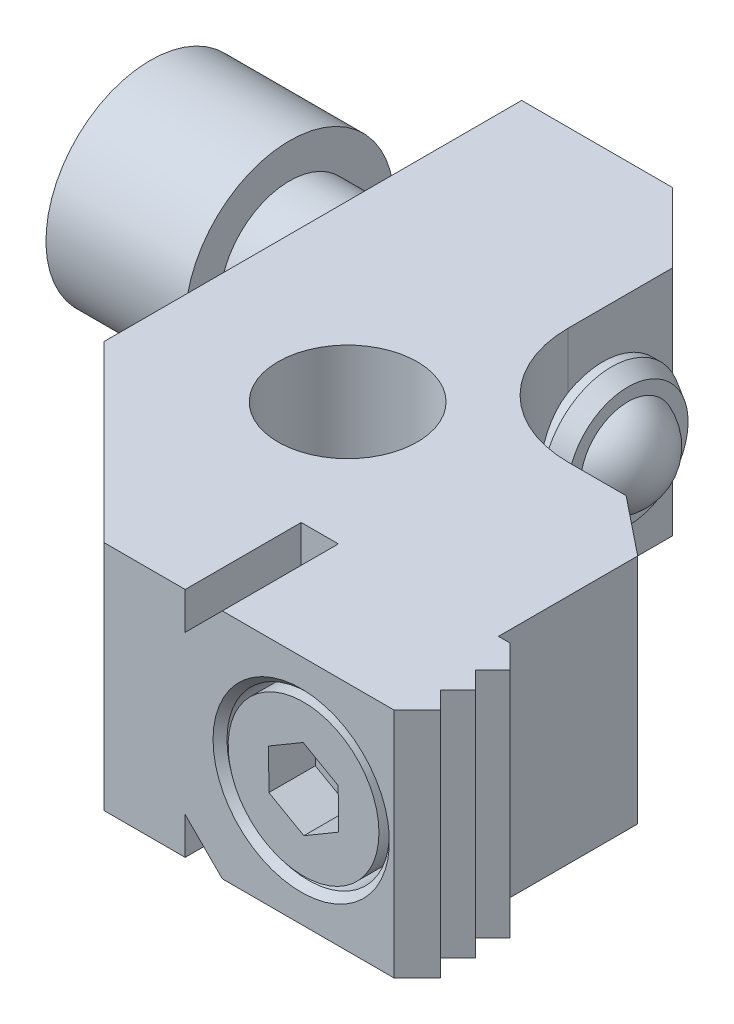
ISO-10303-21;
HEADER;
FILE_DESCRIPTION(('STEP AP214'),'2;1');
FILE_NAME('part.step','',(''),(''),'','','');
FILE_SCHEMA(('AUTOMOTIVE_DESIGN { 1 0 10303 214 1 1 1 1 }'));
ENDSEC;
DATA;
#1=APPLICATION_CONTEXT('core data for automotive mechanical design processes');
#2=APPLICATION_PROTOCOL_DEFINITION('international standard','automotive_design',2000,#1);
#3=PRODUCT_CONTEXT('',#1,'mechanical');
#4=PRODUCT('Part','Part','',(#3));
#5=PRODUCT_RELATED_PRODUCT_CATEGORY('part','',(#4));
#6=PRODUCT_DEFINITION_FORMATION('','',#4);
#7=PRODUCT_DEFINITION_CONTEXT('part definition',#1,'design');
#8=PRODUCT_DEFINITION('design','',#6,#7);
#9=PRODUCT_DEFINITION_SHAPE('','',#8);
#10=(LENGTH_UNIT() NAMED_UNIT(*) SI_UNIT(.MILLI.,.METRE.));
#11=(NAMED_UNIT(*) PLANE_ANGLE_UNIT() SI_UNIT($,.RADIAN.));
#12=(NAMED_UNIT(*) SI_UNIT($,.STERADIAN.) SOLID_ANGLE_UNIT());
#13=UNCERTAINTY_MEASURE_WITH_UNIT(LENGTH_MEASURE(1.E-05),#10,'distance_accuracy_value','');
#14=(GEOMETRIC_REPRESENTATION_CONTEXT(3) GLOBAL_UNCERTAINTY_ASSIGNED_CONTEXT((#13)) GLOBAL_UNIT_ASSIGNED_CONTEXT((#10,
#11,#12)) REPRESENTATION_CONTEXT('',''));
#15=CARTESIAN_POINT('',(0.,0.,0.));
#16=DIRECTION('',(0.,0.,1.));
#17=DIRECTION('',(1.,0.,0.));
#18=AXIS2_PLACEMENT_3D('',#15,#16,#17);
#19=CARTESIAN_POINT('',(17.,0.,11.));
#20=DIRECTION('',(0.,0.,1.));
#21=DIRECTION('',(1.,0.,0.));
#22=AXIS2_PLACEMENT_3D('',#19,#20,#21);
#23=CYLINDRICAL_SURFACE('',#22,4.);
#24=CARTESIAN_POINT('',(17.,0.,3.8));
#25=DIRECTION('',(0.,0.,-1.));
#26=DIRECTION('',(-0.999968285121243,-0.00796421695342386,0.));
#27=AXIS2_PLACEMENT_3D('',#24,#25,#26);
#28=CIRCLE('',#27,4.);
#29=CARTESIAN_POINT('',(13.000126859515,-0.0318568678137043,3.8));
#30=VERTEX_POINT('',#29);
#31=EDGE_CURVE('E294',#30,#30,#28,.T.);
#32=ORIENTED_EDGE('',*,*,#31,.F.);
#33=EDGE_LOOP('',(#32));
#34=FACE_BOUND('',#33,.T.);
#35=CARTESIAN_POINT('',(17.,0.,-5.));
#36=DIRECTION('',(0.,0.,1.));
#37=DIRECTION('',(1.,0.,0.));
#38=AXIS2_PLACEMENT_3D('',#35,#36,#37);
#39=CIRCLE('',#38,4.);
#40=CARTESIAN_POINT('',(19.,3.46410161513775,-5.));
#41=VERTEX_POINT('',#40);
#42=CARTESIAN_POINT('',(14.,2.64575131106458,-5.));
#43=VERTEX_POINT('',#42);
#44=EDGE_CURVE('E380',#41,#43,#39,.T.);
#45=ORIENTED_EDGE('',*,*,#44,.F.);
#46=CARTESIAN_POINT('',(17.,0.,-6.6));
#47=DIRECTION('',(-0.624695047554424,0.,0.780868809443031));
#48=DIRECTION('',(0.780868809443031,0.,0.624695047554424));
#49=AXIS2_PLACEMENT_3D('',#46,#47,#48);
#50=ELLIPSE('',#49,5.12249938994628,4.);
#51=CARTESIAN_POINT('',(19.,-3.46410161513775,-5.));
#52=VERTEX_POINT('',#51);
#53=EDGE_CURVE('E276',#52,#41,#50,.T.);
#54=ORIENTED_EDGE('',*,*,#53,.F.);
#55=CARTESIAN_POINT('',(14.,-2.64575131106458,-5.));
#56=VERTEX_POINT('',#55);
#57=EDGE_CURVE('E381',#56,#52,#39,.T.);
#58=ORIENTED_EDGE('',*,*,#57,.F.);
#59=CARTESIAN_POINT('',(14.,2.64575131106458,-5.));
#60=CARTESIAN_POINT('',(13.9256621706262,2.56147665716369,-5.00000255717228));
#61=CARTESIAN_POINT('',(13.8548997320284,2.4740635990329,-5.0008291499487));
#62=CARTESIAN_POINT('',(13.7209899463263,2.29361996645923,-5.00366809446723));
#63=CARTESIAN_POINT('',(13.6578417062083,2.20059005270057,-5.00568030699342));
#64=CARTESIAN_POINT('',(13.5396393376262,2.00960422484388,-5.01042709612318));
#65=CARTESIAN_POINT('',(13.4845807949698,1.91165103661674,-5.01316127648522));
#66=CARTESIAN_POINT('',(13.3829034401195,1.71149936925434,-5.01892926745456));
#67=CARTESIAN_POINT('',(13.3362846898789,1.60930085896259,-5.02196308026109));
#68=CARTESIAN_POINT('',(13.2095822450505,1.29730878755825,-5.03092190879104));
#69=CARTESIAN_POINT('',(13.1425848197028,1.0820093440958,-5.03670790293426));
#70=CARTESIAN_POINT('',(13.0456875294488,0.643363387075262,-5.04552006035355));
#71=CARTESIAN_POINT('',(13.0157737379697,0.420019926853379,-5.04854725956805));
#72=CARTESIAN_POINT('',(12.9938143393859,-0.0284623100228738,-5.0507426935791));
#73=CARTESIAN_POINT('',(13.0017487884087,-0.253600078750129,-5.04991296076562));
#74=CARTESIAN_POINT('',(13.055218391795,-0.699410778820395,-5.0446952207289));
#75=CARTESIAN_POINT('',(13.1007753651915,-0.920081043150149,-5.0403051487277));
#76=CARTESIAN_POINT('',(13.2281905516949,-1.35043352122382,-5.02962598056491));
#77=CARTESIAN_POINT('',(13.3100000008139,-1.56013007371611,-5.02333943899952));
#78=CARTESIAN_POINT('',(13.4579540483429,-1.86185393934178,-5.01458160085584));
#79=CARTESIAN_POINT('',(13.5114589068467,-1.960264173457,-5.01177505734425));
#80=CARTESIAN_POINT('',(13.6265295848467,-2.15225307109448,-5.00681017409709));
#81=CARTESIAN_POINT('',(13.6880912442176,-2.24583419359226,-5.00465150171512));
#82=CARTESIAN_POINT('',(13.7919957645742,-2.39020238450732,-5.00208929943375));
#83=CARTESIAN_POINT('',(13.8318571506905,-2.44279027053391,-5.00132904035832));
#84=CARTESIAN_POINT('',(13.9140723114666,-2.54585701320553,-5.0002848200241));
#85=CARTESIAN_POINT('',(13.9564222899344,-2.59633889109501,-5.000000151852));
#86=CARTESIAN_POINT('',(14.,-2.64575131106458,-5.));
#87=B_SPLINE_CURVE_WITH_KNOTS('',3,(#59,#60,#61,#62,#63,#64,#65,#66,#67,#68,#69,#70,#71,#72,#73,
#74,#75,#76,#77,#78,#79,#80,#81,#82,#83,#84,#85,#86),.UNSPECIFIED.,.F.,.F.,(4,2,2,2,2,2,2,2,2,2,
2,2,2,4),(0.,0.337006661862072,0.673973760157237,1.01075630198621,1.34754131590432,
2.02073047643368,2.69366674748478,3.36624845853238,4.03922050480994,4.71129005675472,
5.04712369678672,5.38278460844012,5.58068864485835,5.77829825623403),.UNSPECIFIED.);
#88=EDGE_CURVE('E371',#43,#56,#87,.T.);
#89=ORIENTED_EDGE('',*,*,#88,.F.);
#90=EDGE_LOOP('',(#45,#54,#58,#89));
#91=FACE_BOUND('',#90,.T.);
#92=ADVANCED_FACE('F15',(#34,#91),#23,.F.);
#93=CARTESIAN_POINT('',(14.,10.,-5.));
#94=DIRECTION('',(0.,0.,1.));
#95=DIRECTION('',(1.,0.,0.));
#96=AXIS2_PLACEMENT_3D('',#93,#94,#95);
#97=PLANE('',#96);
#98=DIRECTION('',(0.,1.,0.));
#99=VECTOR('',#98,1.);
#100=CARTESIAN_POINT('',(19.,-10.,-5.));
#101=LINE('',#100,#99);
#102=CARTESIAN_POINT('',(19.,10.,-5.));
#103=VERTEX_POINT('',#102);
#104=EDGE_CURVE('E363',#41,#103,#101,.T.);
#105=ORIENTED_EDGE('',*,*,#104,.F.);
#106=ORIENTED_EDGE('',*,*,#44,.T.);
#107=DIRECTION('',(0.,-1.,0.));
#108=VECTOR('',#107,1.);
#109=CARTESIAN_POINT('',(14.,10.,-5.));
#110=LINE('',#109,#108);
#111=CARTESIAN_POINT('',(14.,10.,-5.));
#112=VERTEX_POINT('',#111);
#113=EDGE_CURVE('E296',#112,#43,#110,.T.);
#114=ORIENTED_EDGE('',*,*,#113,.F.);
#115=DIRECTION('',(-1.,0.,0.));
#116=VECTOR('',#115,1.);
#117=CARTESIAN_POINT('',(14.,10.,-5.));
#118=LINE('',#117,#116);
#119=EDGE_CURVE('E317',#103,#112,#118,.T.);
#120=ORIENTED_EDGE('',*,*,#119,.F.);
#121=EDGE_LOOP('',(#105,#106,#114,#120));
#122=FACE_BOUND('',#121,.T.);
#123=ADVANCED_FACE('F391',(#122),#97,.F.);
#124=CARTESIAN_POINT('',(24.,-10.,-0.999999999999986));
#125=DIRECTION('',(-0.624695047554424,0.,0.780868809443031));
#126=DIRECTION('',(0.780868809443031,0.,0.624695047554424));
#127=AXIS2_PLACEMENT_3D('',#124,#125,#126);
#128=PLANE('',#127);
#129=CARTESIAN_POINT('',(19.,-10.,-5.));
#130=VERTEX_POINT('',#129);
#131=EDGE_CURVE('E360',#130,#52,#101,.T.);
#132=ORIENTED_EDGE('',*,*,#131,.T.);
#133=ORIENTED_EDGE('',*,*,#53,.T.);
#134=ORIENTED_EDGE('',*,*,#104,.T.);
#135=DIRECTION('',(0.780868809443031,0.,0.624695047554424));
#136=VECTOR('',#135,1.);
#137=CARTESIAN_POINT('',(24.,10.,-0.999999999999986));
#138=LINE('',#137,#136);
#139=CARTESIAN_POINT('',(24.,10.,-0.999999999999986));
#140=VERTEX_POINT('',#139);
#141=EDGE_CURVE('E369',#103,#140,#138,.T.);
#142=ORIENTED_EDGE('',*,*,#141,.T.);
#143=DIRECTION('',(0.,1.,0.));
#144=VECTOR('',#143,1.);
#145=CARTESIAN_POINT('',(24.,-10.,-0.999999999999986));
#146=LINE('',#145,#144);
#147=CARTESIAN_POINT('',(24.,-10.,-0.999999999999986));
#148=VERTEX_POINT('',#147);
#149=EDGE_CURVE('E359',#148,#140,#146,.T.);
#150=ORIENTED_EDGE('',*,*,#149,.F.);
#151=DIRECTION('',(0.780868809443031,0.,0.624695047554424));
#152=VECTOR('',#151,1.);
#153=CARTESIAN_POINT('',(24.,-10.,-0.999999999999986));
#154=LINE('',#153,#152);
#155=EDGE_CURVE('E366',#130,#148,#154,.T.);
#156=ORIENTED_EDGE('',*,*,#155,.F.);
#157=EDGE_LOOP('',(#132,#133,#134,#142,#150,#156));
#158=FACE_BOUND('',#157,.T.);
#159=ADVANCED_FACE('F393',(#158),#128,.F.);
#160=CARTESIAN_POINT('',(14.,-10.,-5.));
#161=VERTEX_POINT('',#160);
#162=EDGE_CURVE('E299',#56,#161,#110,.T.);
#163=ORIENTED_EDGE('',*,*,#162,.F.);
#164=ORIENTED_EDGE('',*,*,#57,.T.);
#165=ORIENTED_EDGE('',*,*,#131,.F.);
#166=DIRECTION('',(-1.,0.,0.));
#167=VECTOR('',#166,1.);
#168=CARTESIAN_POINT('',(14.,-10.,-5.));
#169=LINE('',#168,#167);
#170=EDGE_CURVE('E341',#130,#161,#169,.T.);
#171=ORIENTED_EDGE('',*,*,#170,.T.);
#172=EDGE_LOOP('',(#163,#164,#165,#171));
#173=FACE_BOUND('',#172,.T.);
#174=ADVANCED_FACE('F397',(#173),#97,.F.);
#175=CARTESIAN_POINT('',(14.,10.,-15.));
#176=DIRECTION('',(0.,-1.,0.));
#177=DIRECTION('',(1.,0.,0.));
#178=AXIS2_PLACEMENT_3D('',#175,#176,#177);
#179=CYLINDRICAL_SURFACE('',#178,10.);
#180=ORIENTED_EDGE('',*,*,#113,.T.);
#181=ORIENTED_EDGE('',*,*,#88,.T.);
#182=ORIENTED_EDGE('',*,*,#162,.T.);
#183=CARTESIAN_POINT('',(14.,-10.,-15.));
#184=DIRECTION('',(0.,-1.,0.));
#185=DIRECTION('',(-1.,0.,0.));
#186=AXIS2_PLACEMENT_3D('',#183,#184,#185);
#187=CIRCLE('',#186,10.);
#188=CARTESIAN_POINT('',(4.,-10.,-15.));
#189=VERTEX_POINT('',#188);
#190=EDGE_CURVE('E338',#161,#189,#187,.T.);
#191=ORIENTED_EDGE('',*,*,#190,.T.);
#192=DIRECTION('',(0.,-1.,0.));
#193=VECTOR('',#192,1.);
#194=CARTESIAN_POINT('',(4.,10.,-15.));
#195=LINE('',#194,#193);
#196=CARTESIAN_POINT('',(4.,-5.19615242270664,-15.));
#197=VERTEX_POINT('',#196);
#198=EDGE_CURVE('E302',#197,#189,#195,.T.);
#199=ORIENTED_EDGE('',*,*,#198,.F.);
#200=CARTESIAN_POINT('',(4.,5.19615242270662,-15.));
#201=CARTESIAN_POINT('',(3.99998467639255,5.11331579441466,-14.856476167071));
#202=CARTESIAN_POINT('',(4.00308934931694,5.02451506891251,-14.7164434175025));
#203=CARTESIAN_POINT('',(4.01452281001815,4.83580937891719,-14.4444044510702));
#204=CARTESIAN_POINT('',(4.02284870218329,4.73591059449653,-14.312393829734));
#205=CARTESIAN_POINT('',(4.0436865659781,4.52598489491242,-14.0575804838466));
#206=CARTESIAN_POINT('',(4.0561887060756,4.41598220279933,-13.9347569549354));
#207=CARTESIAN_POINT('',(4.08431322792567,4.18643763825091,-13.698740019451));
#208=CARTESIAN_POINT('',(4.09993600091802,4.06689457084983,-13.5855478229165));
#209=CARTESIAN_POINT('',(4.13318877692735,3.81930080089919,-13.3696789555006));
#210=CARTESIAN_POINT('',(4.15081524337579,3.69126524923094,-13.2669843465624));
#211=CARTESIAN_POINT('',(4.18703221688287,3.42726180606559,-13.0724477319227));
#212=CARTESIAN_POINT('',(4.20562305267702,3.29129120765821,-12.9806094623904));
#213=CARTESIAN_POINT('',(4.24272680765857,3.01222953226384,-12.8083364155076));
#214=CARTESIAN_POINT('',(4.26123969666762,2.86913593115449,-12.7279057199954));
#215=CARTESIAN_POINT('',(4.29718735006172,2.57673319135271,-12.5789885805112));
#216=CARTESIAN_POINT('',(4.31462212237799,2.42742409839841,-12.5105020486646));
#217=CARTESIAN_POINT('',(4.34805471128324,2.11833972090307,-12.3838209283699));
#218=CARTESIAN_POINT('',(4.36398371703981,1.95838121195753,-12.3260542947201));
#219=CARTESIAN_POINT('',(4.39281026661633,1.63394486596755,-12.2242647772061));
#220=CARTESIAN_POINT('',(4.40570893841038,1.46946873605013,-12.180236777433));
#221=CARTESIAN_POINT('',(4.42775255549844,1.13715608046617,-12.1062877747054));
#222=CARTESIAN_POINT('',(4.43689822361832,0.9693202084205,-12.076364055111));
#223=CARTESIAN_POINT('',(4.45091666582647,0.63153711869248,-12.0308963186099));
#224=CARTESIAN_POINT('',(4.45578962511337,0.461589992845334,-12.0153516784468));
#225=CARTESIAN_POINT('',(4.46089096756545,0.126970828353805,-11.999088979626));
#226=CARTESIAN_POINT('',(4.4612780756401,-0.0376743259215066,-11.9978642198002));
#227=CARTESIAN_POINT('',(4.45779850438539,-0.366458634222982,-12.0089428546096));
#228=CARTESIAN_POINT('',(4.45393191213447,-0.530597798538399,-12.0212459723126));
#229=CARTESIAN_POINT('',(4.44215058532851,-0.857137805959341,-12.0592662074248));
#230=CARTESIAN_POINT('',(4.43423673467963,-1.01953902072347,-12.0849803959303));
#231=CARTESIAN_POINT('',(4.41479075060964,-1.34150245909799,-12.1495836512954));
#232=CARTESIAN_POINT('',(4.40325722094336,-1.5010635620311,-12.1884778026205));
#233=CARTESIAN_POINT('',(4.36448778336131,-1.96902643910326,-12.3231118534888));
#234=CARTESIAN_POINT('',(4.33286222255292,-2.27191962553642,-12.4374251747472));
#235=CARTESIAN_POINT('',(4.26401018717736,-2.85508114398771,-12.7129728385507));
#236=CARTESIAN_POINT('',(4.22677936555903,-3.13533165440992,-12.8742436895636));
#237=CARTESIAN_POINT('',(4.17168106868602,-3.53967150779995,-13.1524013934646));
#238=CARTESIAN_POINT('',(4.1530416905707,-3.67453057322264,-13.2538108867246));
#239=CARTESIAN_POINT('',(4.11749484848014,-3.93534856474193,-13.467733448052));
#240=CARTESIAN_POINT('',(4.10058671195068,-4.06131094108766,-13.5802421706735));
#241=CARTESIAN_POINT('',(4.06969571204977,-4.30327380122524,-13.8154727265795));
#242=CARTESIAN_POINT('',(4.05570801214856,-4.41929056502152,-13.9381771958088));
#243=CARTESIAN_POINT('',(4.03178579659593,-4.64069388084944,-14.1931074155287));
#244=CARTESIAN_POINT('',(4.02184888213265,-4.74608669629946,-14.3253274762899));
#245=CARTESIAN_POINT('',(4.00983078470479,-4.90890199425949,-14.5483114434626));
#246=CARTESIAN_POINT('',(4.00620525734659,-4.9697506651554,-14.6365120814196));
#247=CARTESIAN_POINT('',(4.00128991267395,-5.0866060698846,-14.8159930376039));
#248=CARTESIAN_POINT('',(3.99999762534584,-5.14261786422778,-14.907269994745));
#249=CARTESIAN_POINT('',(4.,-5.19615242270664,-15.));
#250=B_SPLINE_CURVE_WITH_KNOTS('',3,(#200,#201,#202,#203,#204,#205,#206,#207,#208,#209,#210,
#211,#212,#213,#214,#215,#216,#217,#218,#219,#220,#221,#222,#223,#224,#225,#226,#227,#228,#229,
#230,#231,#232,#233,#234,#235,#236,#237,#238,#239,#240,#241,#242,#243,#244,#245,#246,#247,#248,
#249),.UNSPECIFIED.,.F.,.F.,(4,2,2,2,2,2,2,2,2,2,2,2,2,2,2,2,2,2,2,2,2,2,2,2,4),(0.,
0.496908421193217,0.993541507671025,1.48901358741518,1.98454782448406,2.47922062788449,
2.97406317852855,3.46908234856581,3.96409787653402,4.47590611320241,4.98752353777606,
5.4990423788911,6.01053904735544,6.503879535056,6.99720992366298,7.49043261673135,
7.98384579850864,8.95511024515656,9.92713185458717,10.4359013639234,10.9444724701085,
11.4521945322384,11.9596154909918,12.2810954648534,12.6022349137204),.UNSPECIFIED.);
#251=CARTESIAN_POINT('',(4.,5.19615242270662,-15.));
#252=VERTEX_POINT('',#251);
#253=EDGE_CURVE('E706',#252,#197,#250,.T.);
#254=ORIENTED_EDGE('',*,*,#253,.F.);
#255=CARTESIAN_POINT('',(4.,10.,-15.));
#256=VERTEX_POINT('',#255);
#257=EDGE_CURVE('E300',#256,#252,#195,.T.);
#258=ORIENTED_EDGE('',*,*,#257,.F.);
#259=CARTESIAN_POINT('',(14.,10.,-15.));
#260=DIRECTION('',(0.,-1.,0.));
#261=DIRECTION('',(-1.,0.,0.));
#262=AXIS2_PLACEMENT_3D('',#259,#260,#261);
#263=CIRCLE('',#262,10.);
#264=EDGE_CURVE('E260',#112,#256,#263,.T.);
#265=ORIENTED_EDGE('',*,*,#264,.F.);
#266=EDGE_LOOP('',(#180,#181,#182,#191,#199,#254,#258,#265));
#267=FACE_BOUND('',#266,.T.);
#268=ADVANCED_FACE('F383',(#267),#179,.F.);
#269=CARTESIAN_POINT('',(24.,10.,-5.));
#270=DIRECTION('',(-1.,0.,0.));
#271=DIRECTION('',(0.,-1.,0.));
#272=AXIS2_PLACEMENT_3D('',#269,#270,#271);
#273=PLANE('',#272);
#274=DIRECTION('',(0.,0.,-1.));
#275=VECTOR('',#274,1.);
#276=CARTESIAN_POINT('',(24.,-10.,-5.));
#277=LINE('',#276,#275);
#278=CARTESIAN_POINT('',(24.,-10.,11.));
#279=VERTEX_POINT('',#278);
#280=EDGE_CURVE('E344',#279,#148,#277,.T.);
#281=ORIENTED_EDGE('',*,*,#280,.T.);
#282=ORIENTED_EDGE('',*,*,#149,.T.);
#283=DIRECTION('',(0.,0.,-1.));
#284=VECTOR('',#283,1.);
#285=CARTESIAN_POINT('',(24.,10.,-5.));
#286=LINE('',#285,#284);
#287=CARTESIAN_POINT('',(24.,10.,11.));
#288=VERTEX_POINT('',#287);
#289=EDGE_CURVE('E319',#288,#140,#286,.T.);
#290=ORIENTED_EDGE('',*,*,#289,.F.);
#291=DIRECTION('',(0.,-1.,0.));
#292=VECTOR('',#291,1.);
#293=CARTESIAN_POINT('',(24.,10.,11.));
#294=LINE('',#293,#292);
#295=EDGE_CURVE('E292',#288,#279,#294,.T.);
#296=ORIENTED_EDGE('',*,*,#295,.T.);
#297=EDGE_LOOP('',(#281,#282,#290,#296));
#298=FACE_BOUND('',#297,.T.);
#299=ADVANCED_FACE('F430',(#298),#273,.F.);
#300=CARTESIAN_POINT('',(4.,10.,-30.));
#301=DIRECTION('',(-1.,0.,0.));
#302=DIRECTION('',(0.,0.,1.));
#303=AXIS2_PLACEMENT_3D('',#300,#301,#302);
#304=PLANE('',#303);
#305=DIRECTION('',(0.,0.,-1.));
#306=VECTOR('',#305,1.);
#307=CARTESIAN_POINT('',(4.,-10.,-30.));
#308=LINE('',#307,#306);
#309=CARTESIAN_POINT('',(4.,-10.,-24.));
#310=VERTEX_POINT('',#309);
#311=EDGE_CURVE('E336',#189,#310,#308,.T.);
#312=ORIENTED_EDGE('',*,*,#311,.T.);
#313=DIRECTION('',(0.,1.,0.));
#314=VECTOR('',#313,1.);
#315=CARTESIAN_POINT('',(4.,10.,-24.));
#316=LINE('',#315,#314);
#317=CARTESIAN_POINT('',(4.,0.,-24.));
#318=VERTEX_POINT('',#317);
#319=EDGE_CURVE('E252',#310,#318,#316,.T.);
#320=ORIENTED_EDGE('',*,*,#319,.T.);
#321=CARTESIAN_POINT('',(4.,0.,-18.));
#322=DIRECTION('',(-1.,0.,0.));
#323=DIRECTION('',(0.,0.,-1.));
#324=AXIS2_PLACEMENT_3D('',#321,#322,#323);
#325=CIRCLE('',#324,6.);
#326=EDGE_CURVE('E713',#197,#318,#325,.F.);
#327=ORIENTED_EDGE('',*,*,#326,.F.);
#328=ORIENTED_EDGE('',*,*,#198,.T.);
#329=EDGE_LOOP('',(#312,#320,#327,#328));
#330=FACE_BOUND('',#329,.T.);
#331=ADVANCED_FACE('F417',(#330),#304,.F.);
#332=CARTESIAN_POINT('',(27.,0.,-18.));
#333=DIRECTION('',(1.,0.,0.));
#334=DIRECTION('',(0.,0.97804801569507,-0.208379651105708));
#335=AXIS2_PLACEMENT_3D('',#332,#333,#334);
#336=CYLINDRICAL_SURFACE('',#335,6.);
#337=CARTESIAN_POINT('',(4.75,0.,-18.));
#338=DIRECTION('',(1.,0.,0.));
#339=DIRECTION('',(0.,0.97804801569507,-0.208379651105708));
#340=AXIS2_PLACEMENT_3D('',#337,#338,#339);
#341=CIRCLE('',#340,6.);
#342=CARTESIAN_POINT('',(4.75,5.86828809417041,-19.2502779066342));
#343=VERTEX_POINT('',#342);
#344=EDGE_CURVE('E666',#343,#343,#341,.F.);
#345=ORIENTED_EDGE('',*,*,#344,.T.);
#346=EDGE_LOOP('',(#345));
#347=FACE_BOUND('',#346,.T.);
#348=ORIENTED_EDGE('',*,*,#253,.T.);
#349=ORIENTED_EDGE('',*,*,#326,.T.);
#350=CARTESIAN_POINT('',(4.,0.,-18.));
#351=DIRECTION('',(-1.,0.,0.));
#352=DIRECTION('',(0.,0.,-1.));
#353=AXIS2_PLACEMENT_3D('',#350,#351,#352);
#354=CIRCLE('',#353,6.);
#355=EDGE_CURVE('E246',#318,#252,#354,.F.);
#356=ORIENTED_EDGE('',*,*,#355,.T.);
#357=EDGE_LOOP('',(#348,#349,#356));
#358=FACE_BOUND('',#357,.T.);
#359=ADVANCED_FACE('F416',(#347,#358),#336,.T.);
#360=ORIENTED_EDGE('',*,*,#355,.F.);
#361=DIRECTION('',(0.,1.,0.));
#362=VECTOR('',#361,1.);
#363=CARTESIAN_POINT('',(4.,10.,-24.));
#364=LINE('',#363,#362);
#365=CARTESIAN_POINT('',(4.,10.,-24.));
#366=VERTEX_POINT('',#365);
#367=EDGE_CURVE('E241',#318,#366,#364,.T.);
#368=ORIENTED_EDGE('',*,*,#367,.T.);
#369=DIRECTION('',(0.,0.,-1.));
#370=VECTOR('',#369,1.);
#371=CARTESIAN_POINT('',(4.,10.,-30.));
#372=LINE('',#371,#370);
#373=EDGE_CURVE('E245',#256,#366,#372,.T.);
#374=ORIENTED_EDGE('',*,*,#373,.F.);
#375=ORIENTED_EDGE('',*,*,#257,.T.);
#376=EDGE_LOOP('',(#360,#368,#374,#375));
#377=FACE_BOUND('',#376,.T.);
#378=ADVANCED_FACE('F243',(#377),#304,.F.);
#379=CARTESIAN_POINT('',(-2.,10.,-30.));
#380=DIRECTION('',(-0.707106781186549,0.,0.707106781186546));
#381=DIRECTION('',(0.707106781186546,0.,0.707106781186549));
#382=AXIS2_PLACEMENT_3D('',#379,#380,#381);
#383=PLANE('',#382);
#384=ORIENTED_EDGE('',*,*,#367,.F.);
#385=ORIENTED_EDGE('',*,*,#319,.F.);
#386=DIRECTION('',(-0.707106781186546,0.,-0.707106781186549));
#387=VECTOR('',#386,1.);
#388=CARTESIAN_POINT('',(-2.,-10.,-30.));
#389=LINE('',#388,#387);
#390=CARTESIAN_POINT('',(-2.,-10.,-30.));
#391=VERTEX_POINT('',#390);
#392=EDGE_CURVE('E235',#391,#310,#389,.F.);
#393=ORIENTED_EDGE('',*,*,#392,.F.);
#394=DIRECTION('',(0.,-1.,0.));
#395=VECTOR('',#394,1.);
#396=CARTESIAN_POINT('',(-2.,10.,-30.));
#397=LINE('',#396,#395);
#398=CARTESIAN_POINT('',(-2.,10.,-30.));
#399=VERTEX_POINT('',#398);
#400=EDGE_CURVE('E267',#399,#391,#397,.T.);
#401=ORIENTED_EDGE('',*,*,#400,.F.);
#402=DIRECTION('',(0.707106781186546,0.,0.707106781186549));
#403=VECTOR('',#402,1.);
#404=CARTESIAN_POINT('',(13.5,10.,-14.5));
#405=LINE('',#404,#403);
#406=EDGE_CURVE('E19',#366,#399,#405,.F.);
#407=ORIENTED_EDGE('',*,*,#406,.F.);
#408=EDGE_LOOP('',(#384,#385,#393,#401,#407));
#409=FACE_BOUND('',#408,.T.);
#410=ADVANCED_FACE('F265',(#409),#383,.F.);
#411=CARTESIAN_POINT('',(-15.,10.,-30.));
#412=DIRECTION('',(0.,0.,1.));
#413=DIRECTION('',(1.,0.,0.));
#414=AXIS2_PLACEMENT_3D('',#411,#412,#413);
#415=PLANE('',#414);
#416=DIRECTION('',(-1.,0.,0.));
#417=VECTOR('',#416,1.);
#418=CARTESIAN_POINT('',(-15.,10.,-30.));
#419=LINE('',#418,#417);
#420=CARTESIAN_POINT('',(-15.,10.,-30.));
#421=VERTEX_POINT('',#420);
#422=EDGE_CURVE('E262',#399,#421,#419,.T.);
#423=ORIENTED_EDGE('',*,*,#422,.F.);
#424=ORIENTED_EDGE('',*,*,#400,.T.);
#425=DIRECTION('',(-1.,0.,0.));
#426=VECTOR('',#425,1.);
#427=CARTESIAN_POINT('',(-15.,-10.,-30.));
#428=LINE('',#427,#426);
#429=CARTESIAN_POINT('',(-15.,-10.,-30.));
#430=VERTEX_POINT('',#429);
#431=EDGE_CURVE('E334',#391,#430,#428,.T.);
#432=ORIENTED_EDGE('',*,*,#431,.T.);
#433=DIRECTION('',(0.,-1.,0.));
#434=VECTOR('',#433,1.);
#435=CARTESIAN_POINT('',(-15.,10.,-30.));
#436=LINE('',#435,#434);
#437=EDGE_CURVE('E303',#421,#430,#436,.T.);
#438=ORIENTED_EDGE('',*,*,#437,.F.);
#439=EDGE_LOOP('',(#423,#424,#432,#438));
#440=FACE_BOUND('',#439,.T.);
#441=ADVANCED_FACE('F411',(#440),#415,.F.);
#442=CARTESIAN_POINT('',(-15.,10.,21.));
#443=DIRECTION('',(1.,0.,0.));
#444=DIRECTION('',(0.,0.,-1.));
#445=AXIS2_PLACEMENT_3D('',#442,#443,#444);
#446=PLANE('',#445);
#447=CARTESIAN_POINT('',(-15.,0.,-18.));
#448=DIRECTION('',(-1.,0.,0.));
#449=DIRECTION('',(0.,0.,1.));
#450=AXIS2_PLACEMENT_3D('',#447,#448,#449);
#451=CIRCLE('',#450,7.);
#452=CARTESIAN_POINT('',(-15.,0.,-11.));
#453=VERTEX_POINT('',#452);
#454=EDGE_CURVE('E716',#453,#453,#451,.T.);
#455=ORIENTED_EDGE('',*,*,#454,.F.);
#456=EDGE_LOOP('',(#455));
#457=FACE_BOUND('',#456,.T.);
#458=DIRECTION('',(0.,0.,1.));
#459=VECTOR('',#458,1.);
#460=CARTESIAN_POINT('',(-15.,-10.,21.));
#461=LINE('',#460,#459);
#462=CARTESIAN_POINT('',(-15.,-10.,6.));
#463=VERTEX_POINT('',#462);
#464=EDGE_CURVE('E331',#430,#463,#461,.T.);
#465=ORIENTED_EDGE('',*,*,#464,.T.);
#466=DIRECTION('',(0.,1.,0.));
#467=VECTOR('',#466,1.);
#468=CARTESIAN_POINT('',(-15.,10.,6.));
#469=LINE('',#468,#467);
#470=CARTESIAN_POINT('',(-15.,10.,6.));
#471=VERTEX_POINT('',#470);
#472=EDGE_CURVE('E281',#463,#471,#469,.T.);
#473=ORIENTED_EDGE('',*,*,#472,.T.);
#474=DIRECTION('',(0.,0.,1.));
#475=VECTOR('',#474,1.);
#476=CARTESIAN_POINT('',(-15.,10.,21.));
#477=LINE('',#476,#475);
#478=EDGE_CURVE('E312',#421,#471,#477,.T.);
#479=ORIENTED_EDGE('',*,*,#478,.F.);
#480=ORIENTED_EDGE('',*,*,#437,.T.);
#481=EDGE_LOOP('',(#465,#473,#479,#480));
#482=FACE_BOUND('',#481,.T.);
#483=ADVANCED_FACE('F402',(#457,#482),#446,.F.);
#484=CARTESIAN_POINT('',(0.,10.,21.));
#485=DIRECTION('',(0.707106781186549,0.,-0.707106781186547));
#486=DIRECTION('',(-0.707106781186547,0.,-0.707106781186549));
#487=AXIS2_PLACEMENT_3D('',#484,#485,#486);
#488=PLANE('',#487);
#489=DIRECTION('',(-0.707106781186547,0.,-0.707106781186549));
#490=VECTOR('',#489,1.);
#491=CARTESIAN_POINT('',(-11.,10.,10.));
#492=LINE('',#491,#490);
#493=CARTESIAN_POINT('',(0.,10.,21.));
#494=VERTEX_POINT('',#493);
#495=EDGE_CURVE('E279',#471,#494,#492,.F.);
#496=ORIENTED_EDGE('',*,*,#495,.F.);
#497=ORIENTED_EDGE('',*,*,#472,.F.);
#498=DIRECTION('',(0.707106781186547,0.,0.707106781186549));
#499=VECTOR('',#498,1.);
#500=CARTESIAN_POINT('',(0.,-10.,21.));
#501=LINE('',#500,#499);
#502=CARTESIAN_POINT('',(0.,-10.,21.));
#503=VERTEX_POINT('',#502);
#504=EDGE_CURVE('E283',#503,#463,#501,.F.);
#505=ORIENTED_EDGE('',*,*,#504,.F.);
#506=DIRECTION('',(0.,-1.,0.));
#507=VECTOR('',#506,1.);
#508=CARTESIAN_POINT('',(0.,10.,21.));
#509=LINE('',#508,#507);
#510=EDGE_CURVE('E285',#494,#503,#509,.T.);
#511=ORIENTED_EDGE('',*,*,#510,.F.);
#512=EDGE_LOOP('',(#496,#497,#505,#511));
#513=FACE_BOUND('',#512,.T.);
#514=ADVANCED_FACE('F399',(#513),#488,.F.);
#515=CARTESIAN_POINT('',(7.,10.,21.));
#516=DIRECTION('',(-1.,0.,0.));
#517=DIRECTION('',(0.,0.,1.));
#518=AXIS2_PLACEMENT_3D('',#515,#516,#517);
#519=PLANE('',#518);
#520=DIRECTION('',(0.,-1.,0.));
#521=VECTOR('',#520,1.);
#522=CARTESIAN_POINT('',(7.,10.,21.));
#523=LINE('',#522,#521);
#524=CARTESIAN_POINT('',(7.,10.,21.));
#525=VERTEX_POINT('',#524);
#526=CARTESIAN_POINT('',(7.,6.8,21.));
#527=VERTEX_POINT('',#526);
#528=EDGE_CURVE('E306',#525,#527,#523,.T.);
#529=ORIENTED_EDGE('',*,*,#528,.T.);
#530=DIRECTION('',(0.,0.,-1.));
#531=VECTOR('',#530,1.);
#532=CARTESIAN_POINT('',(7.,6.8,21.));
#533=LINE('',#532,#531);
#534=CARTESIAN_POINT('',(7.,6.8,11.));
#535=VERTEX_POINT('',#534);
#536=EDGE_CURVE('E613',#527,#535,#533,.T.);
#537=ORIENTED_EDGE('',*,*,#536,.T.);
#538=DIRECTION('',(0.,-1.,0.));
#539=VECTOR('',#538,1.);
#540=CARTESIAN_POINT('',(7.,10.,11.));
#541=LINE('',#540,#539);
#542=CARTESIAN_POINT('',(7.,10.,11.));
#543=VERTEX_POINT('',#542);
#544=EDGE_CURVE('E288',#543,#535,#541,.T.);
#545=ORIENTED_EDGE('',*,*,#544,.F.);
#546=DIRECTION('',(0.,0.,-1.));
#547=VECTOR('',#546,1.);
#548=CARTESIAN_POINT('',(7.,10.,21.));
#549=LINE('',#548,#547);
#550=EDGE_CURVE('E325',#525,#543,#549,.T.);
#551=ORIENTED_EDGE('',*,*,#550,.F.);
#552=EDGE_LOOP('',(#529,#537,#545,#551));
#553=FACE_BOUND('',#552,.T.);
#554=ADVANCED_FACE('F17',(#553),#519,.F.);
#555=CARTESIAN_POINT('',(7.,10.,11.));
#556=DIRECTION('',(0.,0.,-1.));
#557=DIRECTION('',(-1.,0.,0.));
#558=AXIS2_PLACEMENT_3D('',#555,#556,#557);
#559=PLANE('',#558);
#560=DIRECTION('',(-0.707106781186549,-0.707106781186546,0.));
#561=VECTOR('',#560,1.);
#562=CARTESIAN_POINT('',(7.,6.8,11.));
#563=LINE('',#562,#561);
#564=CARTESIAN_POINT('',(10.2,10.,11.));
#565=VERTEX_POINT('',#564);
#566=EDGE_CURVE('E591',#565,#535,#563,.T.);
#567=ORIENTED_EDGE('',*,*,#566,.F.);
#568=DIRECTION('',(1.,0.,0.));
#569=VECTOR('',#568,1.);
#570=CARTESIAN_POINT('',(7.,10.,11.));
#571=LINE('',#570,#569);
#572=EDGE_CURVE('E322',#543,#565,#571,.T.);
#573=ORIENTED_EDGE('',*,*,#572,.F.);
#574=ORIENTED_EDGE('',*,*,#544,.T.);
#575=EDGE_LOOP('',(#567,#573,#574));
#576=FACE_BOUND('',#575,.T.);
#577=ADVANCED_FACE('F461',(#576),#559,.F.);
#578=CARTESIAN_POINT('',(27.,10.,21.));
#579=DIRECTION('',(0.,-1.,0.));
#580=DIRECTION('',(0.,0.,1.));
#581=AXIS2_PLACEMENT_3D('',#578,#579,#580);
#582=PLANE('',#581);
#583=DIRECTION('',(-1.,0.,0.));
#584=VECTOR('',#583,1.);
#585=CARTESIAN_POINT('',(27.,10.,21.));
#586=LINE('',#585,#584);
#587=CARTESIAN_POINT('',(25.,10.,21.));
#588=VERTEX_POINT('',#587);
#589=CARTESIAN_POINT('',(10.2,10.,21.));
#590=VERTEX_POINT('',#589);
#591=EDGE_CURVE('E598',#588,#590,#586,.T.);
#592=ORIENTED_EDGE('',*,*,#591,.F.);
#593=DIRECTION('',(-0.707106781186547,0.,0.707106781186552));
#594=VECTOR('',#593,1.);
#595=CARTESIAN_POINT('',(27.,10.,19.));
#596=LINE('',#595,#594);
#597=CARTESIAN_POINT('',(27.,10.,19.));
#598=VERTEX_POINT('',#597);
#599=EDGE_CURVE('E557',#598,#588,#596,.T.);
#600=ORIENTED_EDGE('',*,*,#599,.F.);
#601=DIRECTION('',(0.707106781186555,0.,0.707106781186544));
#602=VECTOR('',#601,1.);
#603=CARTESIAN_POINT('',(25.5,10.,17.5));
#604=LINE('',#603,#602);
#605=CARTESIAN_POINT('',(25.5,10.,17.5));
#606=VERTEX_POINT('',#605);
#607=EDGE_CURVE('E554',#606,#598,#604,.T.);
#608=ORIENTED_EDGE('',*,*,#607,.F.);
#609=DIRECTION('',(-0.707106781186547,0.,0.707106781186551));
#610=VECTOR('',#609,1.);
#611=CARTESIAN_POINT('',(27.,10.,16.));
#612=LINE('',#611,#610);
#613=CARTESIAN_POINT('',(27.,10.,16.));
#614=VERTEX_POINT('',#613);
#615=EDGE_CURVE('E548',#614,#606,#612,.T.);
#616=ORIENTED_EDGE('',*,*,#615,.F.);
#617=DIRECTION('',(0.707106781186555,0.,0.707106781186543));
#618=VECTOR('',#617,1.);
#619=CARTESIAN_POINT('',(25.5,10.,14.5));
#620=LINE('',#619,#618);
#621=CARTESIAN_POINT('',(25.5,10.,14.5));
#622=VERTEX_POINT('',#621);
#623=EDGE_CURVE('E546',#622,#614,#620,.T.);
#624=ORIENTED_EDGE('',*,*,#623,.F.);
#625=DIRECTION('',(-0.707106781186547,0.,0.707106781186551));
#626=VECTOR('',#625,1.);
#627=CARTESIAN_POINT('',(27.,10.,13.));
#628=LINE('',#627,#626);
#629=CARTESIAN_POINT('',(27.,10.,13.));
#630=VERTEX_POINT('',#629);
#631=EDGE_CURVE('E539',#630,#622,#628,.T.);
#632=ORIENTED_EDGE('',*,*,#631,.F.);
#633=DIRECTION('',(0.707106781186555,0.,0.707106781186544));
#634=VECTOR('',#633,1.);
#635=CARTESIAN_POINT('',(25.,10.,11.));
#636=LINE('',#635,#634);
#637=CARTESIAN_POINT('',(25.,10.,11.));
#638=VERTEX_POINT('',#637);
#639=EDGE_CURVE('E530',#638,#630,#636,.T.);
#640=ORIENTED_EDGE('',*,*,#639,.F.);
#641=DIRECTION('',(-1.,0.,0.));
#642=VECTOR('',#641,1.);
#643=CARTESIAN_POINT('',(27.,10.,11.));
#644=LINE('',#643,#642);
#645=EDGE_CURVE('E579',#638,#288,#644,.T.);
#646=ORIENTED_EDGE('',*,*,#645,.T.);
#647=ORIENTED_EDGE('',*,*,#289,.T.);
#648=ORIENTED_EDGE('',*,*,#141,.F.);
#649=ORIENTED_EDGE('',*,*,#119,.T.);
#650=ORIENTED_EDGE('',*,*,#264,.T.);
#651=ORIENTED_EDGE('',*,*,#373,.T.);
#652=ORIENTED_EDGE('',*,*,#406,.T.);
#653=ORIENTED_EDGE('',*,*,#422,.T.);
#654=ORIENTED_EDGE('',*,*,#478,.T.);
#655=ORIENTED_EDGE('',*,*,#495,.T.);
#656=DIRECTION('',(1.,0.,0.));
#657=VECTOR('',#656,1.);
#658=CARTESIAN_POINT('',(7.,10.,21.));
#659=LINE('',#658,#657);
#660=EDGE_CURVE('E310',#494,#525,#659,.T.);
#661=ORIENTED_EDGE('',*,*,#660,.T.);
#662=ORIENTED_EDGE('',*,*,#550,.T.);
#663=ORIENTED_EDGE('',*,*,#572,.T.);
#664=DIRECTION('',(0.,0.,-1.));
#665=VECTOR('',#664,1.);
#666=CARTESIAN_POINT('',(10.2,10.,21.));
#667=LINE('',#666,#665);
#668=EDGE_CURVE('E295',#590,#565,#667,.T.);
#669=ORIENTED_EDGE('',*,*,#668,.F.);
#670=EDGE_LOOP('',(#592,#600,#608,#616,#624,#632,#640,#646,#647,#648,#649,#650,#651,#652,#653,
#654,#655,#661,#662,#663,#669));
#671=FACE_BOUND('',#670,.T.);
#672=CARTESIAN_POINT('',(0.,10.,0.));
#673=DIRECTION('',(0.,1.,0.));
#674=DIRECTION('',(-1.,0.,0.));
#675=AXIS2_PLACEMENT_3D('',#672,#673,#674);
#676=CIRCLE('',#675,6.);
#677=CARTESIAN_POINT('',(-6.,10.,0.));
#678=VERTEX_POINT('',#677);
#679=EDGE_CURVE('E353',#678,#678,#676,.T.);
#680=ORIENTED_EDGE('',*,*,#679,.F.);
#681=EDGE_LOOP('',(#680));
#682=FACE_BOUND('',#681,.T.);
#683=ADVANCED_FACE('F256',(#671,#682),#582,.F.);
#684=CARTESIAN_POINT('',(0.,10.,0.));
#685=DIRECTION('',(0.,-1.,0.));
#686=DIRECTION('',(1.,0.,0.));
#687=AXIS2_PLACEMENT_3D('',#684,#685,#686);
#688=CYLINDRICAL_SURFACE('',#687,6.);
#689=ORIENTED_EDGE('',*,*,#679,.T.);
#690=EDGE_LOOP('',(#689));
#691=FACE_BOUND('',#690,.T.);
#692=CARTESIAN_POINT('',(0.,-10.,0.));
#693=DIRECTION('',(0.,1.,0.));
#694=DIRECTION('',(-1.,0.,0.));
#695=AXIS2_PLACEMENT_3D('',#692,#693,#694);
#696=CIRCLE('',#695,6.);
#697=CARTESIAN_POINT('',(-6.,-10.,0.));
#698=VERTEX_POINT('',#697);
#699=EDGE_CURVE('E356',#698,#698,#696,.T.);
#700=ORIENTED_EDGE('',*,*,#699,.F.);
#701=EDGE_LOOP('',(#700));
#702=FACE_BOUND('',#701,.T.);
#703=ADVANCED_FACE('F404',(#691,#702),#688,.F.);
#704=CARTESIAN_POINT('',(27.,10.,11.));
#705=DIRECTION('',(0.,0.,1.));
#706=DIRECTION('',(-1.,0.,0.));
#707=AXIS2_PLACEMENT_3D('',#704,#705,#706);
#708=PLANE('',#707);
#709=ORIENTED_EDGE('',*,*,#295,.F.);
#710=ORIENTED_EDGE('',*,*,#645,.F.);
#711=DIRECTION('',(0.,1.,0.));
#712=VECTOR('',#711,1.);
#713=CARTESIAN_POINT('',(25.,-10.,11.));
#714=LINE('',#713,#712);
#715=CARTESIAN_POINT('',(25.,-10.,11.));
#716=VERTEX_POINT('',#715);
#717=EDGE_CURVE('E536',#716,#638,#714,.T.);
#718=ORIENTED_EDGE('',*,*,#717,.F.);
#719=DIRECTION('',(1.,0.,0.));
#720=VECTOR('',#719,1.);
#721=CARTESIAN_POINT('',(27.,-10.,11.));
#722=LINE('',#721,#720);
#723=EDGE_CURVE('E596',#279,#716,#722,.T.);
#724=ORIENTED_EDGE('',*,*,#723,.F.);
#725=EDGE_LOOP('',(#709,#710,#718,#724));
#726=FACE_BOUND('',#725,.T.);
#727=ADVANCED_FACE('F407',(#726),#708,.F.);
#728=CARTESIAN_POINT('',(27.,-10.,21.));
#729=DIRECTION('',(0.,1.,0.));
#730=DIRECTION('',(0.,0.,-1.));
#731=AXIS2_PLACEMENT_3D('',#728,#729,#730);
#732=PLANE('',#731);
#733=DIRECTION('',(0.707106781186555,0.,0.707106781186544));
#734=VECTOR('',#733,1.);
#735=CARTESIAN_POINT('',(25.5,-10.,17.5));
#736=LINE('',#735,#734);
#737=CARTESIAN_POINT('',(25.5,-10.,17.5));
#738=VERTEX_POINT('',#737);
#739=CARTESIAN_POINT('',(27.,-10.,19.));
#740=VERTEX_POINT('',#739);
#741=EDGE_CURVE('E571',#738,#740,#736,.T.);
#742=ORIENTED_EDGE('',*,*,#741,.T.);
#743=DIRECTION('',(-0.707106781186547,0.,0.707106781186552));
#744=VECTOR('',#743,1.);
#745=CARTESIAN_POINT('',(27.,-10.,19.));
#746=LINE('',#745,#744);
#747=CARTESIAN_POINT('',(25.,-10.,21.));
#748=VERTEX_POINT('',#747);
#749=EDGE_CURVE('E573',#740,#748,#746,.T.);
#750=ORIENTED_EDGE('',*,*,#749,.T.);
#751=DIRECTION('',(1.,0.,0.));
#752=VECTOR('',#751,1.);
#753=CARTESIAN_POINT('',(27.,-10.,21.));
#754=LINE('',#753,#752);
#755=CARTESIAN_POINT('',(10.2,-10.,21.));
#756=VERTEX_POINT('',#755);
#757=EDGE_CURVE('E605',#756,#748,#754,.T.);
#758=ORIENTED_EDGE('',*,*,#757,.F.);
#759=DIRECTION('',(0.,0.,-1.));
#760=VECTOR('',#759,1.);
#761=CARTESIAN_POINT('',(10.2,-10.,21.));
#762=LINE('',#761,#760);
#763=CARTESIAN_POINT('',(10.2,-10.,11.));
#764=VERTEX_POINT('',#763);
#765=EDGE_CURVE('E608',#756,#764,#762,.T.);
#766=ORIENTED_EDGE('',*,*,#765,.T.);
#767=DIRECTION('',(1.,0.,0.));
#768=VECTOR('',#767,1.);
#769=CARTESIAN_POINT('',(7.,-10.,11.));
#770=LINE('',#769,#768);
#771=CARTESIAN_POINT('',(7.,-10.,11.));
#772=VERTEX_POINT('',#771);
#773=EDGE_CURVE('E347',#772,#764,#770,.T.);
#774=ORIENTED_EDGE('',*,*,#773,.F.);
#775=DIRECTION('',(0.,0.,-1.));
#776=VECTOR('',#775,1.);
#777=CARTESIAN_POINT('',(7.,-10.,21.));
#778=LINE('',#777,#776);
#779=CARTESIAN_POINT('',(7.,-10.,21.));
#780=VERTEX_POINT('',#779);
#781=EDGE_CURVE('E350',#780,#772,#778,.T.);
#782=ORIENTED_EDGE('',*,*,#781,.F.);
#783=DIRECTION('',(1.,0.,0.));
#784=VECTOR('',#783,1.);
#785=CARTESIAN_POINT('',(7.,-10.,21.));
#786=LINE('',#785,#784);
#787=EDGE_CURVE('E328',#503,#780,#786,.T.);
#788=ORIENTED_EDGE('',*,*,#787,.F.);
#789=ORIENTED_EDGE('',*,*,#504,.T.);
#790=ORIENTED_EDGE('',*,*,#464,.F.);
#791=ORIENTED_EDGE('',*,*,#431,.F.);
#792=ORIENTED_EDGE('',*,*,#392,.T.);
#793=ORIENTED_EDGE('',*,*,#311,.F.);
#794=ORIENTED_EDGE('',*,*,#190,.F.);
#795=ORIENTED_EDGE('',*,*,#170,.F.);
#796=ORIENTED_EDGE('',*,*,#155,.T.);
#797=ORIENTED_EDGE('',*,*,#280,.F.);
#798=ORIENTED_EDGE('',*,*,#723,.T.);
#799=DIRECTION('',(0.707106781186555,0.,0.707106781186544));
#800=VECTOR('',#799,1.);
#801=CARTESIAN_POINT('',(25.,-10.,11.));
#802=LINE('',#801,#800);
#803=CARTESIAN_POINT('',(27.,-10.,13.));
#804=VERTEX_POINT('',#803);
#805=EDGE_CURVE('E559',#716,#804,#802,.T.);
#806=ORIENTED_EDGE('',*,*,#805,.T.);
#807=DIRECTION('',(-0.707106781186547,0.,0.707106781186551));
#808=VECTOR('',#807,1.);
#809=CARTESIAN_POINT('',(27.,-10.,13.));
#810=LINE('',#809,#808);
#811=CARTESIAN_POINT('',(25.5,-10.,14.5));
#812=VERTEX_POINT('',#811);
#813=EDGE_CURVE('E562',#804,#812,#810,.T.);
#814=ORIENTED_EDGE('',*,*,#813,.T.);
#815=DIRECTION('',(0.707106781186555,0.,0.707106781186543));
#816=VECTOR('',#815,1.);
#817=CARTESIAN_POINT('',(25.5,-10.,14.5));
#818=LINE('',#817,#816);
#819=CARTESIAN_POINT('',(27.,-10.,16.));
#820=VERTEX_POINT('',#819);
#821=EDGE_CURVE('E565',#812,#820,#818,.T.);
#822=ORIENTED_EDGE('',*,*,#821,.T.);
#823=DIRECTION('',(-0.707106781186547,0.,0.707106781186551));
#824=VECTOR('',#823,1.);
#825=CARTESIAN_POINT('',(27.,-10.,16.));
#826=LINE('',#825,#824);
#827=EDGE_CURVE('E568',#820,#738,#826,.T.);
#828=ORIENTED_EDGE('',*,*,#827,.T.);
#829=EDGE_LOOP('',(#742,#750,#758,#766,#774,#782,#788,#789,#790,#791,#792,#793,#794,#795,#796,
#797,#798,#806,#814,#822,#828));
#830=FACE_BOUND('',#829,.T.);
#831=ORIENTED_EDGE('',*,*,#699,.T.);
#832=EDGE_LOOP('',(#831));
#833=FACE_BOUND('',#832,.T.);
#834=ADVANCED_FACE('F439',(#830,#833),#732,.F.);
#835=DIRECTION('',(0.707106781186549,-0.707106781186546,0.));
#836=VECTOR('',#835,1.);
#837=CARTESIAN_POINT('',(10.2,-10.,11.));
#838=LINE('',#837,#836);
#839=CARTESIAN_POINT('',(7.,-6.8,11.));
#840=VERTEX_POINT('',#839);
#841=EDGE_CURVE('E594',#840,#764,#838,.T.);
#842=ORIENTED_EDGE('',*,*,#841,.F.);
#843=EDGE_CURVE('E291',#840,#772,#541,.T.);
#844=ORIENTED_EDGE('',*,*,#843,.T.);
#845=ORIENTED_EDGE('',*,*,#773,.T.);
#846=EDGE_LOOP('',(#842,#844,#845));
#847=FACE_BOUND('',#846,.T.);
#848=ADVANCED_FACE('F431',(#847),#559,.F.);
#849=ORIENTED_EDGE('',*,*,#843,.F.);
#850=DIRECTION('',(0.,0.,-1.));
#851=VECTOR('',#850,1.);
#852=CARTESIAN_POINT('',(7.,-6.8,21.));
#853=LINE('',#852,#851);
#854=CARTESIAN_POINT('',(7.,-6.8,21.));
#855=VERTEX_POINT('',#854);
#856=EDGE_CURVE('E611',#855,#840,#853,.T.);
#857=ORIENTED_EDGE('',*,*,#856,.F.);
#858=EDGE_CURVE('E309',#855,#780,#523,.T.);
#859=ORIENTED_EDGE('',*,*,#858,.T.);
#860=ORIENTED_EDGE('',*,*,#781,.T.);
#861=EDGE_LOOP('',(#849,#857,#859,#860));
#862=FACE_BOUND('',#861,.T.);
#863=ADVANCED_FACE('F458',(#862),#519,.F.);
#864=CARTESIAN_POINT('',(4.7500000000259,0.,-18.));
#865=DIRECTION('',(-1.,0.,0.));
#866=DIRECTION('',(0.,-0.97804801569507,0.208379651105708));
#867=AXIS2_PLACEMENT_3D('',#864,#865,#866);
#868=CONICAL_SURFACE('',#867,5.99999999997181,0.5235987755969);
#869=ORIENTED_EDGE('',*,*,#344,.F.);
#870=EDGE_LOOP('',(#869));
#871=FACE_BOUND('',#870,.T.);
#872=CARTESIAN_POINT('',(6.1499999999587,0.,-18.));
#873=DIRECTION('',(-1.,0.,0.));
#874=DIRECTION('',(0.,-0.97804801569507,0.208379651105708));
#875=AXIS2_PLACEMENT_3D('',#872,#873,#874);
#876=CIRCLE('',#875,5.19170962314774);
#877=CARTESIAN_POINT('',(6.1499999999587,-5.07774129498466,-16.9181533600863));
#878=VERTEX_POINT('',#877);
#879=EDGE_CURVE('E1235',#878,#878,#876,.T.);
#880=ORIENTED_EDGE('',*,*,#879,.T.);
#881=EDGE_LOOP('',(#880));
#882=FACE_BOUND('',#881,.T.);
#883=ADVANCED_FACE('F428',(#871,#882),#868,.T.);
#884=CARTESIAN_POINT('',(-10.,0.,-18.));
#885=DIRECTION('',(-1.,0.,0.));
#886=DIRECTION('',(0.,0.,1.));
#887=AXIS2_PLACEMENT_3D('',#884,#885,#886);
#888=CYLINDRICAL_SURFACE('',#887,7.);
#889=CARTESIAN_POINT('',(-10.,0.,-18.));
#890=DIRECTION('',(-1.,0.,0.));
#891=DIRECTION('',(0.,0.,1.));
#892=AXIS2_PLACEMENT_3D('',#889,#890,#891);
#893=CIRCLE('',#892,7.);
#894=CARTESIAN_POINT('',(-10.,0.,-11.));
#895=VERTEX_POINT('',#894);
#896=EDGE_CURVE('E718',#895,#895,#893,.T.);
#897=ORIENTED_EDGE('',*,*,#896,.F.);
#898=EDGE_LOOP('',(#897));
#899=FACE_BOUND('',#898,.T.);
#900=ORIENTED_EDGE('',*,*,#454,.T.);
#901=EDGE_LOOP('',(#900));
#902=FACE_BOUND('',#901,.T.);
#903=ADVANCED_FACE('F699',(#899,#902),#888,.F.);
#904=CARTESIAN_POINT('',(10.,0.,15.8));
#905=DIRECTION('',(0.,0.,-1.));
#906=DIRECTION('',(1.,0.,0.));
#907=AXIS2_PLACEMENT_3D('',#904,#905,#906);
#908=PLANE('',#907);
#909=CARTESIAN_POINT('',(17.,0.,15.8));
#910=DIRECTION('',(0.,0.,1.));
#911=DIRECTION('',(-1.,0.,0.));
#912=AXIS2_PLACEMENT_3D('',#909,#910,#911);
#913=CIRCLE('',#912,7.);
#914=CARTESIAN_POINT('',(10.,0.,15.8));
#915=VERTEX_POINT('',#914);
#916=EDGE_CURVE('E1276',#915,#915,#913,.T.);
#917=ORIENTED_EDGE('',*,*,#916,.T.);
#918=EDGE_LOOP('',(#917));
#919=FACE_BOUND('',#918,.T.);
#920=CARTESIAN_POINT('',(17.,0.,15.8));
#921=DIRECTION('',(0.,0.,-1.));
#922=DIRECTION('',(-0.999968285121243,-0.00796421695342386,0.));
#923=AXIS2_PLACEMENT_3D('',#920,#921,#922);
#924=CIRCLE('',#923,6.5);
#925=CARTESIAN_POINT('',(10.5002061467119,-0.0517674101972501,15.8));
#926=VERTEX_POINT('',#925);
#927=EDGE_CURVE('E1330',#926,#926,#924,.T.);
#928=ORIENTED_EDGE('',*,*,#927,.T.);
#929=EDGE_LOOP('',(#928));
#930=FACE_BOUND('',#929,.T.);
#931=ADVANCED_FACE('F448',(#919,#930),#908,.F.);
#932=CARTESIAN_POINT('',(17.,0.,21.));
#933=DIRECTION('',(0.,0.,1.));
#934=DIRECTION('',(-1.,0.,0.));
#935=AXIS2_PLACEMENT_3D('',#932,#933,#934);
#936=CYLINDRICAL_SURFACE('',#935,7.);
#937=ORIENTED_EDGE('',*,*,#916,.F.);
#938=EDGE_LOOP('',(#937));
#939=FACE_BOUND('',#938,.T.);
#940=CARTESIAN_POINT('',(17.,0.,20.399999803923));
#941=DIRECTION('',(0.,0.,1.));
#942=DIRECTION('',(-1.,0.,0.));
#943=AXIS2_PLACEMENT_3D('',#940,#941,#942);
#944=CIRCLE('',#943,7.);
#945=CARTESIAN_POINT('',(10.,0.,20.3999998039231));
#946=VERTEX_POINT('',#945);
#947=EDGE_CURVE('E1281',#946,#946,#944,.T.);
#948=ORIENTED_EDGE('',*,*,#947,.T.);
#949=EDGE_LOOP('',(#948));
#950=FACE_BOUND('',#949,.T.);
#951=ADVANCED_FACE('F491',(#939,#950),#936,.F.);
#952=CARTESIAN_POINT('',(17.,0.,21.));
#953=DIRECTION('',(0.,0.,1.));
#954=DIRECTION('',(-1.,0.,0.));
#955=AXIS2_PLACEMENT_3D('',#952,#953,#954);
#956=CONICAL_SURFACE('',#955,7.6,0.785398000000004);
#957=ORIENTED_EDGE('',*,*,#947,.F.);
#958=EDGE_LOOP('',(#957));
#959=FACE_BOUND('',#958,.T.);
#960=CARTESIAN_POINT('',(17.,0.,21.));
#961=DIRECTION('',(0.,0.,1.));
#962=DIRECTION('',(-1.,0.,0.));
#963=AXIS2_PLACEMENT_3D('',#960,#961,#962);
#964=CIRCLE('',#963,7.6);
#965=CARTESIAN_POINT('',(9.4,0.,21.));
#966=VERTEX_POINT('',#965);
#967=EDGE_CURVE('E540',#966,#966,#964,.T.);
#968=ORIENTED_EDGE('',*,*,#967,.T.);
#969=EDGE_LOOP('',(#968));
#970=FACE_BOUND('',#969,.T.);
#971=ADVANCED_FACE('F481',(#959,#970),#956,.F.);
#972=CARTESIAN_POINT('',(27.,10.,21.));
#973=DIRECTION('',(0.,0.,1.));
#974=DIRECTION('',(-1.,0.,0.));
#975=AXIS2_PLACEMENT_3D('',#972,#973,#974);
#976=PLANE('',#975);
#977=ORIENTED_EDGE('',*,*,#967,.F.);
#978=EDGE_LOOP('',(#977));
#979=FACE_BOUND('',#978,.T.);
#980=DIRECTION('',(0.,1.,0.));
#981=VECTOR('',#980,1.);
#982=CARTESIAN_POINT('',(25.,-10.,21.));
#983=LINE('',#982,#981);
#984=EDGE_CURVE('E576',#748,#588,#983,.T.);
#985=ORIENTED_EDGE('',*,*,#984,.T.);
#986=ORIENTED_EDGE('',*,*,#591,.T.);
#987=DIRECTION('',(-0.707106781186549,-0.707106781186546,0.));
#988=VECTOR('',#987,1.);
#989=CARTESIAN_POINT('',(7.,6.8,21.));
#990=LINE('',#989,#988);
#991=EDGE_CURVE('E600',#590,#527,#990,.T.);
#992=ORIENTED_EDGE('',*,*,#991,.T.);
#993=ORIENTED_EDGE('',*,*,#528,.F.);
#994=ORIENTED_EDGE('',*,*,#660,.F.);
#995=ORIENTED_EDGE('',*,*,#510,.T.);
#996=ORIENTED_EDGE('',*,*,#787,.T.);
#997=ORIENTED_EDGE('',*,*,#858,.F.);
#998=DIRECTION('',(0.707106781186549,-0.707106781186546,0.));
#999=VECTOR('',#998,1.);
#1000=CARTESIAN_POINT('',(10.2,-10.,21.));
#1001=LINE('',#1000,#999);
#1002=EDGE_CURVE('E603',#855,#756,#1001,.T.);
#1003=ORIENTED_EDGE('',*,*,#1002,.T.);
#1004=ORIENTED_EDGE('',*,*,#757,.T.);
#1005=EDGE_LOOP('',(#985,#986,#992,#993,#994,#995,#996,#997,#1003,#1004));
#1006=FACE_BOUND('',#1005,.T.);
#1007=ADVANCED_FACE('F472',(#979,#1006),#976,.T.);
#1008=CARTESIAN_POINT('',(7.,6.8,21.));
#1009=DIRECTION('',(0.707106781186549,-0.707106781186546,0.));
#1010=DIRECTION('',(0.707106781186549,0.707106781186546,0.));
#1011=AXIS2_PLACEMENT_3D('',#1008,#1009,#1010);
#1012=PLANE('',#1011);
#1013=ORIENTED_EDGE('',*,*,#566,.T.);
#1014=ORIENTED_EDGE('',*,*,#536,.F.);
#1015=ORIENTED_EDGE('',*,*,#991,.F.);
#1016=ORIENTED_EDGE('',*,*,#668,.T.);
#1017=EDGE_LOOP('',(#1013,#1014,#1015,#1016));
#1018=FACE_BOUND('',#1017,.T.);
#1019=ADVANCED_FACE('F464',(#1018),#1012,.F.);
#1020=CARTESIAN_POINT('',(27.,-10.,19.));
#1021=DIRECTION('',(-0.707106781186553,0.,-0.707106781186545));
#1022=DIRECTION('',(0.707106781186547,0.,-0.707106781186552));
#1023=AXIS2_PLACEMENT_3D('',#1020,#1021,#1022);
#1024=PLANE('',#1023);
#1025=ORIENTED_EDGE('',*,*,#599,.T.);
#1026=ORIENTED_EDGE('',*,*,#984,.F.);
#1027=ORIENTED_EDGE('',*,*,#749,.F.);
#1028=DIRECTION('',(0.,1.,0.));
#1029=VECTOR('',#1028,1.);
#1030=CARTESIAN_POINT('',(27.,-10.,19.));
#1031=LINE('',#1030,#1029);
#1032=EDGE_CURVE('E580',#740,#598,#1031,.T.);
#1033=ORIENTED_EDGE('',*,*,#1032,.T.);
#1034=EDGE_LOOP('',(#1025,#1026,#1027,#1033));
#1035=FACE_BOUND('',#1034,.T.);
#1036=ADVANCED_FACE('F483',(#1035),#1024,.F.);
#1037=CARTESIAN_POINT('',(25.5,-10.,17.5));
#1038=DIRECTION('',(-0.707106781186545,0.,0.707106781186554));
#1039=DIRECTION('',(-0.707106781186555,0.,-0.707106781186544));
#1040=AXIS2_PLACEMENT_3D('',#1037,#1038,#1039);
#1041=PLANE('',#1040);
#1042=ORIENTED_EDGE('',*,*,#607,.T.);
#1043=ORIENTED_EDGE('',*,*,#1032,.F.);
#1044=ORIENTED_EDGE('',*,*,#741,.F.);
#1045=DIRECTION('',(0.,1.,0.));
#1046=VECTOR('',#1045,1.);
#1047=CARTESIAN_POINT('',(25.5,-10.,17.5));
#1048=LINE('',#1047,#1046);
#1049=EDGE_CURVE('E582',#738,#606,#1048,.T.);
#1050=ORIENTED_EDGE('',*,*,#1049,.T.);
#1051=EDGE_LOOP('',(#1042,#1043,#1044,#1050));
#1052=FACE_BOUND('',#1051,.T.);
#1053=ADVANCED_FACE('F497',(#1052),#1041,.F.);
#1054=CARTESIAN_POINT('',(27.,-10.,16.));
#1055=DIRECTION('',(-0.707106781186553,0.,-0.707106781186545));
#1056=DIRECTION('',(0.707106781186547,0.,-0.707106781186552));
#1057=AXIS2_PLACEMENT_3D('',#1054,#1055,#1056);
#1058=PLANE('',#1057);
#1059=ORIENTED_EDGE('',*,*,#615,.T.);
#1060=ORIENTED_EDGE('',*,*,#1049,.F.);
#1061=ORIENTED_EDGE('',*,*,#827,.F.);
#1062=DIRECTION('',(0.,1.,0.));
#1063=VECTOR('',#1062,1.);
#1064=CARTESIAN_POINT('',(27.,-10.,16.));
#1065=LINE('',#1064,#1063);
#1066=EDGE_CURVE('E584',#820,#614,#1065,.T.);
#1067=ORIENTED_EDGE('',*,*,#1066,.T.);
#1068=EDGE_LOOP('',(#1059,#1060,#1061,#1067));
#1069=FACE_BOUND('',#1068,.T.);
#1070=ADVANCED_FACE('F504',(#1069),#1058,.F.);
#1071=CARTESIAN_POINT('',(25.5,-10.,14.5));
#1072=DIRECTION('',(-0.707106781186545,0.,0.707106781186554));
#1073=DIRECTION('',(-0.707106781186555,0.,-0.707106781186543));
#1074=AXIS2_PLACEMENT_3D('',#1071,#1072,#1073);
#1075=PLANE('',#1074);
#1076=ORIENTED_EDGE('',*,*,#623,.T.);
#1077=ORIENTED_EDGE('',*,*,#1066,.F.);
#1078=ORIENTED_EDGE('',*,*,#821,.F.);
#1079=DIRECTION('',(0.,1.,0.));
#1080=VECTOR('',#1079,1.);
#1081=CARTESIAN_POINT('',(25.5,-10.,14.5));
#1082=LINE('',#1081,#1080);
#1083=EDGE_CURVE('E586',#812,#622,#1082,.T.);
#1084=ORIENTED_EDGE('',*,*,#1083,.T.);
#1085=EDGE_LOOP('',(#1076,#1077,#1078,#1084));
#1086=FACE_BOUND('',#1085,.T.);
#1087=ADVANCED_FACE('F511',(#1086),#1075,.F.);
#1088=CARTESIAN_POINT('',(27.,-10.,13.));
#1089=DIRECTION('',(-0.707106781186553,0.,-0.707106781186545));
#1090=DIRECTION('',(0.707106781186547,0.,-0.707106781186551));
#1091=AXIS2_PLACEMENT_3D('',#1088,#1089,#1090);
#1092=PLANE('',#1091);
#1093=ORIENTED_EDGE('',*,*,#631,.T.);
#1094=ORIENTED_EDGE('',*,*,#1083,.F.);
#1095=ORIENTED_EDGE('',*,*,#813,.F.);
#1096=DIRECTION('',(0.,1.,0.));
#1097=VECTOR('',#1096,1.);
#1098=CARTESIAN_POINT('',(27.,-10.,13.));
#1099=LINE('',#1098,#1097);
#1100=EDGE_CURVE('E533',#804,#630,#1099,.T.);
#1101=ORIENTED_EDGE('',*,*,#1100,.T.);
#1102=EDGE_LOOP('',(#1093,#1094,#1095,#1101));
#1103=FACE_BOUND('',#1102,.T.);
#1104=ADVANCED_FACE('F515',(#1103),#1092,.F.);
#1105=CARTESIAN_POINT('',(25.,-10.,11.));
#1106=DIRECTION('',(-0.707106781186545,0.,0.707106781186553));
#1107=DIRECTION('',(-0.707106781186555,0.,-0.707106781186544));
#1108=AXIS2_PLACEMENT_3D('',#1105,#1106,#1107);
#1109=PLANE('',#1108);
#1110=ORIENTED_EDGE('',*,*,#639,.T.);
#1111=ORIENTED_EDGE('',*,*,#1100,.F.);
#1112=ORIENTED_EDGE('',*,*,#805,.F.);
#1113=ORIENTED_EDGE('',*,*,#717,.T.);
#1114=EDGE_LOOP('',(#1110,#1111,#1112,#1113));
#1115=FACE_BOUND('',#1114,.T.);
#1116=ADVANCED_FACE('F465',(#1115),#1109,.F.);
#1117=CARTESIAN_POINT('',(10.2,-10.,21.));
#1118=DIRECTION('',(0.707106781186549,0.707106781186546,0.));
#1119=DIRECTION('',(-0.707106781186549,0.707106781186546,0.));
#1120=AXIS2_PLACEMENT_3D('',#1117,#1118,#1119);
#1121=PLANE('',#1120);
#1122=ORIENTED_EDGE('',*,*,#841,.T.);
#1123=ORIENTED_EDGE('',*,*,#765,.F.);
#1124=ORIENTED_EDGE('',*,*,#1002,.F.);
#1125=ORIENTED_EDGE('',*,*,#856,.T.);
#1126=EDGE_LOOP('',(#1122,#1123,#1124,#1125));
#1127=FACE_BOUND('',#1126,.T.);
#1128=ADVANCED_FACE('F490',(#1127),#1121,.F.);
#1129=CARTESIAN_POINT('',(6.15,5.0777412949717,-19.0818466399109));
#1130=DIRECTION('',(-1.,0.,0.));
#1131=DIRECTION('',(0.,-0.97804801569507,0.208379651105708));
#1132=AXIS2_PLACEMENT_3D('',#1129,#1130,#1131);
#1133=PLANE('',#1132);
#1134=ORIENTED_EDGE('',*,*,#879,.F.);
#1135=EDGE_LOOP('',(#1134));
#1136=FACE_BOUND('',#1135,.T.);
#1137=CARTESIAN_POINT('',(6.15,3.99356299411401,-18.8508552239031));
#1138=CARTESIAN_POINT('',(6.15,4.01745166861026,-18.7387283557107));
#1139=CARTESIAN_POINT('',(6.15,4.03661960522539,-18.6255741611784));
#1140=CARTESIAN_POINT('',(6.15,4.0653694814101,-18.3980335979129));
#1141=CARTESIAN_POINT('',(6.15,4.07494858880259,-18.2836468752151));
#1142=CARTESIAN_POINT('',(6.15,4.08445122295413,-18.0542802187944));
#1143=CARTESIAN_POINT('',(6.15,4.08435936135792,-17.9392996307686));
#1144=CARTESIAN_POINT('',(6.15,4.0744881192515,-17.7096906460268));
#1145=CARTESIAN_POINT('',(6.15,4.06470086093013,-17.5950626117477));
#1146=CARTESIAN_POINT('',(6.15,4.02090457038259,-17.2534179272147));
#1147=CARTESIAN_POINT('',(6.15,3.97248339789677,-17.0280862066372));
#1148=CARTESIAN_POINT('',(6.15,3.83844420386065,-16.5887625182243));
#1149=CARTESIAN_POINT('',(6.15,3.75282476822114,-16.3747709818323));
#1150=CARTESIAN_POINT('',(6.15,3.59848882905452,-16.066966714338));
#1151=CARTESIAN_POINT('',(6.15,3.54268073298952,-15.9665010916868));
#1152=CARTESIAN_POINT('',(6.15,3.42284356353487,-15.7706980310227));
#1153=CARTESIAN_POINT('',(6.15,3.35882246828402,-15.6753557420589));
#1154=CARTESIAN_POINT('',(6.15,3.22295137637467,-15.4903652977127));
#1155=CARTESIAN_POINT('',(6.15,3.15109784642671,-15.4007197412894));
#1156=CARTESIAN_POINT('',(6.15,3.00007862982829,-15.2277787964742));
#1157=CARTESIAN_POINT('',(6.15,2.92091125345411,-15.1444848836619));
#1158=CARTESIAN_POINT('',(6.15,2.75586024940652,-14.9848877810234));
#1159=CARTESIAN_POINT('',(6.15,2.66997889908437,-14.9085822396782));
#1160=CARTESIAN_POINT('',(6.15,2.49209093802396,-14.7634611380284));
#1161=CARTESIAN_POINT('',(6.15,2.4000820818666,-14.6946483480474));
#1162=CARTESIAN_POINT('',(6.15,2.11588984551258,-14.5002781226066));
#1163=CARTESIAN_POINT('',(6.15,1.91535949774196,-14.3866138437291));
#1164=CARTESIAN_POINT('',(6.15,1.49815873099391,-14.1946333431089));
#1165=CARTESIAN_POINT('',(6.15,1.28148822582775,-14.1163173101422));
#1166=CARTESIAN_POINT('',(6.15,0.838078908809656,-13.9971476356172));
#1167=CARTESIAN_POINT('',(6.15,0.61134009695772,-13.956293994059));
#1168=CARTESIAN_POINT('',(6.15,0.154107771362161,-13.9132638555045));
#1169=CARTESIAN_POINT('',(6.15,-0.0763857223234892,-13.911087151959));
#1170=CARTESIAN_POINT('',(6.15,-0.419727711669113,-13.9368027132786));
#1171=CARTESIAN_POINT('',(6.15,-0.53383648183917,-13.9502198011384));
#1172=CARTESIAN_POINT('',(6.15,-0.760507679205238,-13.9866125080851));
#1173=CARTESIAN_POINT('',(6.15,-0.873070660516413,-14.009584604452));
#1174=CARTESIAN_POINT('',(6.15,-1.09589132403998,-14.0649382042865));
#1175=CARTESIAN_POINT('',(6.15,-1.2061482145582,-14.0973228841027));
#1176=CARTESIAN_POINT('',(6.15,-1.42351693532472,-14.1712567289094));
#1177=CARTESIAN_POINT('',(6.15,-1.53062948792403,-14.2128037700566));
#1178=CARTESIAN_POINT('',(6.15,-1.7409314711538,-14.3047575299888));
#1179=CARTESIAN_POINT('',(6.15,-1.84412265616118,-14.3551602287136));
#1180=CARTESIAN_POINT('',(6.15,-2.04597139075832,-14.4645077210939));
#1181=CARTESIAN_POINT('',(6.15,-2.14462446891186,-14.5234607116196));
#1182=CARTESIAN_POINT('',(6.15,-2.43247081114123,-14.7124250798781));
#1183=CARTESIAN_POINT('',(6.15,-2.61382994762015,-14.8546640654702));
#1184=CARTESIAN_POINT('',(6.15,-2.95004556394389,-15.1676031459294));
#1185=CARTESIAN_POINT('',(6.15,-3.10490305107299,-15.3383021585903));
#1186=CARTESIAN_POINT('',(6.15,-3.31406712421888,-15.6119617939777));
#1187=CARTESIAN_POINT('',(6.15,-3.37999944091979,-15.7062396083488));
#1188=CARTESIAN_POINT('',(6.15,-3.50364503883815,-15.8999649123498));
#1189=CARTESIAN_POINT('',(6.15,-3.56136495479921,-15.9994081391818));
#1190=CARTESIAN_POINT('',(6.15,-3.66812543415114,-16.2026359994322));
#1191=CARTESIAN_POINT('',(6.15,-3.71717964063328,-16.3064134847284));
#1192=CARTESIAN_POINT('',(6.15,-3.80637062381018,-16.5177100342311));
#1193=CARTESIAN_POINT('',(6.15,-3.84651002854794,-16.625227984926));
#1194=CARTESIAN_POINT('',(6.15,-3.90426013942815,-16.8023400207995));
#1195=CARTESIAN_POINT('',(6.15,-3.92467410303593,-16.8710335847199));
#1196=CARTESIAN_POINT('',(6.15,-3.96186095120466,-17.0093992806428));
#1197=CARTESIAN_POINT('',(6.15,-3.97863383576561,-17.0790714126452));
#1198=CARTESIAN_POINT('',(6.15,-4.01745166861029,-17.2612716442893));
#1199=CARTESIAN_POINT('',(6.15,-4.03661960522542,-17.3744258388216));
#1200=CARTESIAN_POINT('',(6.15,-4.06536948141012,-17.6019664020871));
#1201=CARTESIAN_POINT('',(6.15,-4.07494858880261,-17.716353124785));
#1202=CARTESIAN_POINT('',(6.15,-4.08445122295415,-17.9457197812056));
#1203=CARTESIAN_POINT('',(6.15,-4.08435936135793,-18.0607003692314));
#1204=CARTESIAN_POINT('',(6.15,-4.07448811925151,-18.2903093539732));
#1205=CARTESIAN_POINT('',(6.15,-4.06470086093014,-18.4049373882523));
#1206=CARTESIAN_POINT('',(6.15,-4.02090457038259,-18.7465820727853));
#1207=CARTESIAN_POINT('',(6.15,-3.97248339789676,-18.9719137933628));
#1208=CARTESIAN_POINT('',(6.15,-3.83844420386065,-19.4112374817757));
#1209=CARTESIAN_POINT('',(6.15,-3.75282476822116,-19.6252290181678));
#1210=CARTESIAN_POINT('',(6.15,-3.59848882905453,-19.9330332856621));
#1211=CARTESIAN_POINT('',(6.15,-3.54268073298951,-20.0334989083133));
#1212=CARTESIAN_POINT('',(6.15,-3.42284356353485,-20.2293019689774));
#1213=CARTESIAN_POINT('',(6.15,-3.35882246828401,-20.3246442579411));
#1214=CARTESIAN_POINT('',(6.15,-3.22295137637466,-20.5096347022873));
#1215=CARTESIAN_POINT('',(6.15,-3.15109784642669,-20.5992802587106));
#1216=CARTESIAN_POINT('',(6.15,-3.00007862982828,-20.7722212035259));
#1217=CARTESIAN_POINT('',(6.15,-2.92091125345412,-20.8555151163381));
#1218=CARTESIAN_POINT('',(6.15,-2.75586024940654,-21.0151122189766));
#1219=CARTESIAN_POINT('',(6.15,-2.66997889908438,-21.0914177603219));
#1220=CARTESIAN_POINT('',(6.15,-2.49209093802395,-21.2365388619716));
#1221=CARTESIAN_POINT('',(6.15,-2.40008208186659,-21.3053516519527));
#1222=CARTESIAN_POINT('',(6.15,-2.11588984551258,-21.4997218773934));
#1223=CARTESIAN_POINT('',(6.15,-1.91535949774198,-21.6133861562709));
#1224=CARTESIAN_POINT('',(6.15,-1.49815873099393,-21.8053666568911));
#1225=CARTESIAN_POINT('',(6.15,-1.28148822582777,-21.8836826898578));
#1226=CARTESIAN_POINT('',(6.15,-0.838078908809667,-22.0028523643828));
#1227=CARTESIAN_POINT('',(6.15,-0.611340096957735,-22.0437060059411));
#1228=CARTESIAN_POINT('',(6.15,-0.15410777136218,-22.0867361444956));
#1229=CARTESIAN_POINT('',(6.15,0.0763857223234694,-22.088912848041));
#1230=CARTESIAN_POINT('',(6.15,0.419727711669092,-22.0631972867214));
#1231=CARTESIAN_POINT('',(6.15,0.533836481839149,-22.0497801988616));
#1232=CARTESIAN_POINT('',(6.15,0.760507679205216,-22.0133874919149));
#1233=CARTESIAN_POINT('',(6.15,0.87307066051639,-21.990415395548));
#1234=CARTESIAN_POINT('',(6.15,1.09589132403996,-21.9350617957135));
#1235=CARTESIAN_POINT('',(6.15,1.20614821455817,-21.9026771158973));
#1236=CARTESIAN_POINT('',(6.15,1.4235169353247,-21.8287432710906));
#1237=CARTESIAN_POINT('',(6.15,1.53062948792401,-21.7871962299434));
#1238=CARTESIAN_POINT('',(6.15,1.74093147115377,-21.6952424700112));
#1239=CARTESIAN_POINT('',(6.15,1.84412265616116,-21.6448397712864));
#1240=CARTESIAN_POINT('',(6.15,2.0459713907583,-21.5354922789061));
#1241=CARTESIAN_POINT('',(6.15,2.14462446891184,-21.4765392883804));
#1242=CARTESIAN_POINT('',(6.15,2.43247081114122,-21.287574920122));
#1243=CARTESIAN_POINT('',(6.15,2.61382994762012,-21.1453359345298));
#1244=CARTESIAN_POINT('',(6.15,2.95004556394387,-20.8323968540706));
#1245=CARTESIAN_POINT('',(6.15,3.10490305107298,-20.6616978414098));
#1246=CARTESIAN_POINT('',(6.15,3.31406712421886,-20.3880382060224));
#1247=CARTESIAN_POINT('',(6.15,3.37999944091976,-20.2937603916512));
#1248=CARTESIAN_POINT('',(6.15,3.50364503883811,-20.1000350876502));
#1249=CARTESIAN_POINT('',(6.15,3.56136495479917,-20.0005918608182));
#1250=CARTESIAN_POINT('',(6.15,3.6681254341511,-19.7973640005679));
#1251=CARTESIAN_POINT('',(6.15,3.71717964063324,-19.6935865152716));
#1252=CARTESIAN_POINT('',(6.15,3.80637062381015,-19.4822899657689));
#1253=CARTESIAN_POINT('',(6.15,3.84651002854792,-19.374772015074));
#1254=CARTESIAN_POINT('',(6.15,3.90426013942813,-19.1976599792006));
#1255=CARTESIAN_POINT('',(6.15,3.9246741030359,-19.1289664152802));
#1256=CARTESIAN_POINT('',(6.15,3.96186095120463,-18.9906007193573));
#1257=CARTESIAN_POINT('',(6.15,3.97863383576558,-18.9209285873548));
#1258=CARTESIAN_POINT('',(6.15,3.99356299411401,-18.8508552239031));
#1259=B_SPLINE_CURVE_WITH_KNOTS('',3,(#1137,#1138,#1139,#1140,#1141,#1142,#1143,#1144,#1145,
#1146,#1147,#1148,#1149,#1150,#1151,#1152,#1153,#1154,#1155,#1156,#1157,#1158,#1159,#1160,#1161,
#1162,#1163,#1164,#1165,#1166,#1167,#1168,#1169,#1170,#1171,#1172,#1173,#1174,#1175,#1176,#1177,
#1178,#1179,#1180,#1181,#1182,#1183,#1184,#1185,#1186,#1187,#1188,#1189,#1190,#1191,#1192,#1193,
#1194,#1195,#1196,#1197,#1198,#1199,#1200,#1201,#1202,#1203,#1204,#1205,#1206,#1207,#1208,#1209,
#1210,#1211,#1212,#1213,#1214,#1215,#1216,#1217,#1218,#1219,#1220,#1221,#1222,#1223,#1224,#1225,
#1226,#1227,#1228,#1229,#1230,#1231,#1232,#1233,#1234,#1235,#1236,#1237,#1238,#1239,#1240,#1241,
#1242,#1243,#1244,#1245,#1246,#1247,#1248,#1249,#1250,#1251,#1252,#1253,#1254,#1255,#1256,#1257,
#1258),.UNSPECIFIED.,.T.,.F.,(4,2,2,2,2,2,2,2,2,2,2,2,2,2,2,2,2,2,2,2,2,2,2,2,2,2,2,2,2,2,2,2,2,
2,2,2,2,2,2,2,2,2,2,2,2,2,2,2,2,2,2,2,2,2,2,2,2,2,2,2,4),(0.,0.343864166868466,
0.687829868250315,1.0323428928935,1.37713607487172,2.06507885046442,2.75304778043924,
3.09748299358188,3.44158611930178,3.78584512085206,4.1301838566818,4.47440629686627,
4.81875557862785,5.50670775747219,6.19466361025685,6.8826194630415,7.57057164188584,
7.91492092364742,8.25914336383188,8.60348209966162,8.94774110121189,9.29184422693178,
9.63627944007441,10.3242483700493,11.012191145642,11.3569843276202,11.7014973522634,
12.0454630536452,12.3893272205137,12.6042241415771,12.8191210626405,13.162985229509,
13.5069509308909,13.851463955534,14.1962571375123,14.884199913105,15.5721688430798,
15.9166040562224,16.2607071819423,16.6049661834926,16.9493049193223,17.2935273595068,
17.6378766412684,18.3258288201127,19.0137846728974,19.701740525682,20.3896927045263,
20.7340419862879,21.0782644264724,21.4226031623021,21.7668621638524,22.1109652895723,
22.4554005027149,23.1433694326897,23.8313122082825,24.1761053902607,24.5206184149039,
24.8645841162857,25.2084482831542,25.4233452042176,25.638242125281),.UNSPECIFIED.);
#1260=CARTESIAN_POINT('',(6.15,3.99356299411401,-18.8508552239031));
#1261=VERTEX_POINT('',#1260);
#1262=EDGE_CURVE('E680',#1261,#1261,#1259,.T.);
#1263=ORIENTED_EDGE('',*,*,#1262,.F.);
#1264=EDGE_LOOP('',(#1263));
#1265=FACE_BOUND('',#1264,.T.);
#1266=ADVANCED_FACE('F526',(#1136,#1265),#1133,.F.);
#1267=CARTESIAN_POINT('',(-10.,0.,-18.));
#1268=DIRECTION('',(-1.,0.,0.));
#1269=DIRECTION('',(0.,0.,1.));
#1270=AXIS2_PLACEMENT_3D('',#1267,#1268,#1269);
#1271=PLANE('',#1270);
#1272=ORIENTED_EDGE('',*,*,#896,.T.);
#1273=EDGE_LOOP('',(#1272));
#1274=FACE_BOUND('',#1273,.T.);
#1275=CARTESIAN_POINT('',(-10.,0.,-18.));
#1276=DIRECTION('',(-1.,0.,0.));
#1277=DIRECTION('',(0.,0.,-1.));
#1278=AXIS2_PLACEMENT_3D('',#1275,#1276,#1277);
#1279=CIRCLE('',#1278,6.);
#1280=CARTESIAN_POINT('',(-10.,0.,-24.));
#1281=VERTEX_POINT('',#1280);
#1282=EDGE_CURVE('E1230',#1281,#1281,#1279,.F.);
#1283=ORIENTED_EDGE('',*,*,#1282,.T.);
#1284=EDGE_LOOP('',(#1283));
#1285=FACE_BOUND('',#1284,.T.);
#1286=ADVANCED_FACE('F424',(#1274,#1285),#1271,.T.);
#1287=CARTESIAN_POINT('',(4.65,0.,-18.));
#1288=DIRECTION('',(0.,0.97804801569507,-0.208379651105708));
#1289=DIRECTION('',(-1.,0.,0.));
#1290=AXIS2_PLACEMENT_3D('',#1287,#1288,#1289);
#1291=SPHERICAL_SURFACE('',#1290,4.35);
#1292=ORIENTED_EDGE('',*,*,#1262,.T.);
#1293=EDGE_LOOP('',(#1292));
#1294=FACE_BOUND('',#1293,.T.);
#1295=ADVANCED_FACE('F669',(#1294),#1291,.T.);
#1296=ORIENTED_EDGE('',*,*,#1282,.F.);
#1297=EDGE_LOOP('',(#1296));
#1298=FACE_BOUND('',#1297,.T.);
#1299=CARTESIAN_POINT('',(-23.,0.,-18.));
#1300=DIRECTION('',(1.,0.,0.));
#1301=DIRECTION('',(0.,0.97804801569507,-0.208379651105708));
#1302=AXIS2_PLACEMENT_3D('',#1299,#1300,#1301);
#1303=CIRCLE('',#1302,6.);
#1304=CARTESIAN_POINT('',(-23.,5.86828809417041,-19.2502779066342));
#1305=VERTEX_POINT('',#1304);
#1306=EDGE_CURVE('E1232',#1305,#1305,#1303,.T.);
#1307=ORIENTED_EDGE('',*,*,#1306,.T.);
#1308=EDGE_LOOP('',(#1307));
#1309=FACE_BOUND('',#1308,.T.);
#1310=ADVANCED_FACE('F427',(#1298,#1309),#336,.T.);
#1311=CARTESIAN_POINT('',(-23.,5.86828809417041,-19.2502779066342));
#1312=DIRECTION('',(1.,0.,0.));
#1313=DIRECTION('',(0.,0.97804801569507,-0.208379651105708));
#1314=AXIS2_PLACEMENT_3D('',#1311,#1312,#1313);
#1315=PLANE('',#1314);
#1316=ORIENTED_EDGE('',*,*,#1306,.F.);
#1317=EDGE_LOOP('',(#1316));
#1318=FACE_BOUND('',#1317,.T.);
#1319=CARTESIAN_POINT('',(-23.,0.,-18.));
#1320=DIRECTION('',(1.,0.,0.));
#1321=DIRECTION('',(0.,0.97804801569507,-0.208379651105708));
#1322=AXIS2_PLACEMENT_3D('',#1319,#1320,#1321);
#1323=CIRCLE('',#1322,9.);
#1324=CARTESIAN_POINT('',(-23.,8.80243214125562,-19.8754168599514));
#1325=VERTEX_POINT('',#1324);
#1326=EDGE_CURVE('E687',#1325,#1325,#1323,.T.);
#1327=ORIENTED_EDGE('',*,*,#1326,.T.);
#1328=EDGE_LOOP('',(#1327));
#1329=FACE_BOUND('',#1328,.T.);
#1330=ADVANCED_FACE('F694',(#1318,#1329),#1315,.T.);
#1331=CARTESIAN_POINT('',(27.,0.,-18.));
#1332=DIRECTION('',(1.,0.,0.));
#1333=DIRECTION('',(0.,0.97804801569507,-0.208379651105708));
#1334=AXIS2_PLACEMENT_3D('',#1331,#1332,#1333);
#1335=CYLINDRICAL_SURFACE('',#1334,9.);
#1336=CARTESIAN_POINT('',(-35.,0.,-18.));
#1337=DIRECTION('',(1.,0.,0.));
#1338=DIRECTION('',(0.,0.97804801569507,-0.208379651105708));
#1339=AXIS2_PLACEMENT_3D('',#1336,#1337,#1338);
#1340=CIRCLE('',#1339,9.);
#1341=CARTESIAN_POINT('',(-35.,8.80243214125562,-19.8754168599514));
#1342=VERTEX_POINT('',#1341);
#1343=EDGE_CURVE('E649',#1342,#1342,#1340,.T.);
#1344=ORIENTED_EDGE('',*,*,#1343,.T.);
#1345=EDGE_LOOP('',(#1344));
#1346=FACE_BOUND('',#1345,.T.);
#1347=ORIENTED_EDGE('',*,*,#1326,.F.);
#1348=EDGE_LOOP('',(#1347));
#1349=FACE_BOUND('',#1348,.T.);
#1350=ADVANCED_FACE('F677',(#1346,#1349),#1335,.T.);
#1351=CARTESIAN_POINT('',(-35.,8.80243214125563,-19.8754168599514));
#1352=DIRECTION('',(-1.,0.,0.));
#1353=DIRECTION('',(0.,-0.97804801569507,0.208379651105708));
#1354=AXIS2_PLACEMENT_3D('',#1351,#1352,#1353);
#1355=PLANE('',#1354);
#1356=ORIENTED_EDGE('',*,*,#1343,.F.);
#1357=EDGE_LOOP('',(#1356));
#1358=FACE_BOUND('',#1357,.T.);
#1359=DIRECTION('',(0.,0.208379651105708,0.97804801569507));
#1360=VECTOR('',#1359,1.);
#1361=CARTESIAN_POINT('',(-35.,-4.89024007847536,-16.9581017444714));
#1362=LINE('',#1361,#1360);
#1363=CARTESIAN_POINT('',(-35.,-4.28869984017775,-14.1347203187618));
#1364=VERTEX_POINT('',#1363);
#1365=CARTESIAN_POINT('',(-35.,-5.49178031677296,-19.7814831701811));
#1366=VERTEX_POINT('',#1365);
#1367=EDGE_CURVE('E650',#1364,#1366,#1362,.F.);
#1368=ORIENTED_EDGE('',*,*,#1367,.T.);
#1369=DIRECTION('',(0.,0.742824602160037,-0.669486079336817));
#1370=VECTOR('',#1369,1.);
#1371=CARTESIAN_POINT('',(-35.,-5.49178031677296,-19.7814831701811));
#1372=LINE('',#1371,#1370);
#1373=CARTESIAN_POINT('',(-35.,-1.20308047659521,-23.6467628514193));
#1374=VERTEX_POINT('',#1373);
#1375=EDGE_CURVE('E646',#1366,#1374,#1372,.T.);
#1376=ORIENTED_EDGE('',*,*,#1375,.T.);
#1377=DIRECTION('',(0.,0.951204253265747,0.308561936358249));
#1378=VECTOR('',#1377,1.);
#1379=CARTESIAN_POINT('',(-35.,-1.20308047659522,-23.6467628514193));
#1380=LINE('',#1379,#1378);
#1381=CARTESIAN_POINT('',(-35.,4.28869984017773,-21.8652796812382));
#1382=VERTEX_POINT('',#1381);
#1383=EDGE_CURVE('E640',#1374,#1382,#1380,.T.);
#1384=ORIENTED_EDGE('',*,*,#1383,.T.);
#1385=DIRECTION('',(0.,0.208379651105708,0.97804801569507));
#1386=VECTOR('',#1385,1.);
#1387=CARTESIAN_POINT('',(-35.,4.89024007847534,-19.0418982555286));
#1388=LINE('',#1387,#1386);
#1389=CARTESIAN_POINT('',(-35.,5.49178031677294,-16.218516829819));
#1390=VERTEX_POINT('',#1389);
#1391=EDGE_CURVE('E659',#1382,#1390,#1388,.T.);
#1392=ORIENTED_EDGE('',*,*,#1391,.T.);
#1393=DIRECTION('',(0.,-0.742824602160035,0.66948607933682));
#1394=VECTOR('',#1393,1.);
#1395=CARTESIAN_POINT('',(-35.,5.49178031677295,-16.218516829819));
#1396=LINE('',#1395,#1394);
#1397=CARTESIAN_POINT('',(-35.,1.20308047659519,-12.3532371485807));
#1398=VERTEX_POINT('',#1397);
#1399=EDGE_CURVE('E656',#1390,#1398,#1396,.T.);
#1400=ORIENTED_EDGE('',*,*,#1399,.T.);
#1401=DIRECTION('',(0.,-0.951204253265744,-0.308561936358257));
#1402=VECTOR('',#1401,1.);
#1403=CARTESIAN_POINT('',(-35.,1.2030804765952,-12.3532371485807));
#1404=LINE('',#1403,#1402);
#1405=EDGE_CURVE('E653',#1398,#1364,#1404,.T.);
#1406=ORIENTED_EDGE('',*,*,#1405,.T.);
#1407=EDGE_LOOP('',(#1368,#1376,#1384,#1392,#1400,#1406));
#1408=FACE_BOUND('',#1407,.T.);
#1409=ADVANCED_FACE('F675',(#1358,#1408),#1355,.T.);
#1410=CARTESIAN_POINT('',(-29.,-4.28869984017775,-14.1347203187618));
#1411=DIRECTION('',(0.,0.97804801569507,-0.208379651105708));
#1412=DIRECTION('',(0.,0.208379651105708,0.97804801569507));
#1413=AXIS2_PLACEMENT_3D('',#1410,#1411,#1412);
#1414=PLANE('',#1413);
#1415=DIRECTION('',(1.,0.,0.));
#1416=VECTOR('',#1415,1.);
#1417=CARTESIAN_POINT('',(-29.,-4.28869984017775,-14.1347203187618));
#1418=LINE('',#1417,#1416);
#1419=CARTESIAN_POINT('',(-29.,-4.28869984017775,-14.1347203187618));
#1420=VERTEX_POINT('',#1419);
#1421=EDGE_CURVE('E629',#1364,#1420,#1418,.T.);
#1422=ORIENTED_EDGE('',*,*,#1421,.T.);
#1423=DIRECTION('',(0.,0.208379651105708,0.97804801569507));
#1424=VECTOR('',#1423,1.);
#1425=CARTESIAN_POINT('',(-29.,-4.28869984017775,-14.1347203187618));
#1426=LINE('',#1425,#1424);
#1427=CARTESIAN_POINT('',(-29.,-5.49178031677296,-19.7814831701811));
#1428=VERTEX_POINT('',#1427);
#1429=EDGE_CURVE('E631',#1420,#1428,#1426,.F.);
#1430=ORIENTED_EDGE('',*,*,#1429,.T.);
#1431=DIRECTION('',(1.,0.,0.));
#1432=VECTOR('',#1431,1.);
#1433=CARTESIAN_POINT('',(-29.,-5.49178031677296,-19.7814831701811));
#1434=LINE('',#1433,#1432);
#1435=EDGE_CURVE('E637',#1366,#1428,#1434,.T.);
#1436=ORIENTED_EDGE('',*,*,#1435,.F.);
#1437=ORIENTED_EDGE('',*,*,#1367,.F.);
#1438=EDGE_LOOP('',(#1422,#1430,#1436,#1437));
#1439=FACE_BOUND('',#1438,.T.);
#1440=ADVANCED_FACE('F1199',(#1439),#1414,.T.);
#1441=CARTESIAN_POINT('',(-29.,-5.49178031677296,-19.7814831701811));
#1442=DIRECTION('',(0.,0.669486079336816,0.742824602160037));
#1443=DIRECTION('',(0.,-0.742824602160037,0.669486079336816));
#1444=AXIS2_PLACEMENT_3D('',#1441,#1442,#1443);
#1445=PLANE('',#1444);
#1446=ORIENTED_EDGE('',*,*,#1375,.F.);
#1447=ORIENTED_EDGE('',*,*,#1435,.T.);
#1448=DIRECTION('',(0.,-0.742824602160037,0.669486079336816));
#1449=VECTOR('',#1448,1.);
#1450=CARTESIAN_POINT('',(-29.,-5.49178031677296,-19.7814831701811));
#1451=LINE('',#1450,#1449);
#1452=CARTESIAN_POINT('',(-29.,-1.20308047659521,-23.6467628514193));
#1453=VERTEX_POINT('',#1452);
#1454=EDGE_CURVE('E634',#1428,#1453,#1451,.F.);
#1455=ORIENTED_EDGE('',*,*,#1454,.T.);
#1456=DIRECTION('',(1.,0.,0.));
#1457=VECTOR('',#1456,1.);
#1458=CARTESIAN_POINT('',(-29.,-1.20308047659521,-23.6467628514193));
#1459=LINE('',#1458,#1457);
#1460=EDGE_CURVE('E641',#1453,#1374,#1459,.F.);
#1461=ORIENTED_EDGE('',*,*,#1460,.T.);
#1462=EDGE_LOOP('',(#1446,#1447,#1455,#1461));
#1463=FACE_BOUND('',#1462,.T.);
#1464=ADVANCED_FACE('F1190',(#1463),#1445,.T.);
#1465=CARTESIAN_POINT('',(-29.,4.28869984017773,-21.8652796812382));
#1466=DIRECTION('',(0.,0.308561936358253,-0.951204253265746));
#1467=DIRECTION('',(0.,0.951204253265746,0.308561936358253));
#1468=AXIS2_PLACEMENT_3D('',#1465,#1466,#1467);
#1469=PLANE('',#1468);
#1470=ORIENTED_EDGE('',*,*,#1383,.F.);
#1471=ORIENTED_EDGE('',*,*,#1460,.F.);
#1472=DIRECTION('',(0.,0.951204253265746,0.308561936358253));
#1473=VECTOR('',#1472,1.);
#1474=CARTESIAN_POINT('',(-29.,4.28869984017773,-21.8652796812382));
#1475=LINE('',#1474,#1473);
#1476=CARTESIAN_POINT('',(-29.,4.28869984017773,-21.8652796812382));
#1477=VERTEX_POINT('',#1476);
#1478=EDGE_CURVE('E268',#1477,#1453,#1475,.F.);
#1479=ORIENTED_EDGE('',*,*,#1478,.F.);
#1480=DIRECTION('',(1.,0.,0.));
#1481=VECTOR('',#1480,1.);
#1482=CARTESIAN_POINT('',(-29.,4.28869984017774,-21.8652796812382));
#1483=LINE('',#1482,#1481);
#1484=EDGE_CURVE('E617',#1477,#1382,#1483,.F.);
#1485=ORIENTED_EDGE('',*,*,#1484,.T.);
#1486=EDGE_LOOP('',(#1470,#1471,#1479,#1485));
#1487=FACE_BOUND('',#1486,.T.);
#1488=ADVANCED_FACE('F1181',(#1487),#1469,.F.);
#1489=CARTESIAN_POINT('',(-29.,5.49178031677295,-16.218516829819));
#1490=DIRECTION('',(0.,0.97804801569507,-0.208379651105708));
#1491=DIRECTION('',(0.,0.208379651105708,0.97804801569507));
#1492=AXIS2_PLACEMENT_3D('',#1489,#1490,#1491);
#1493=PLANE('',#1492);
#1494=ORIENTED_EDGE('',*,*,#1391,.F.);
#1495=ORIENTED_EDGE('',*,*,#1484,.F.);
#1496=DIRECTION('',(0.,0.208379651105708,0.97804801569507));
#1497=VECTOR('',#1496,1.);
#1498=CARTESIAN_POINT('',(-29.,5.49178031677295,-16.218516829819));
#1499=LINE('',#1498,#1497);
#1500=CARTESIAN_POINT('',(-29.,5.49178031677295,-16.218516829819));
#1501=VERTEX_POINT('',#1500);
#1502=EDGE_CURVE('E269',#1501,#1477,#1499,.F.);
#1503=ORIENTED_EDGE('',*,*,#1502,.F.);
#1504=DIRECTION('',(1.,0.,0.));
#1505=VECTOR('',#1504,1.);
#1506=CARTESIAN_POINT('',(-29.,5.49178031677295,-16.218516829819));
#1507=LINE('',#1506,#1505);
#1508=EDGE_CURVE('E619',#1390,#1501,#1507,.T.);
#1509=ORIENTED_EDGE('',*,*,#1508,.F.);
#1510=EDGE_LOOP('',(#1494,#1495,#1503,#1509));
#1511=FACE_BOUND('',#1510,.T.);
#1512=ADVANCED_FACE('F1172',(#1511),#1493,.F.);
#1513=CARTESIAN_POINT('',(-29.,5.49178031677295,-16.218516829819));
#1514=DIRECTION('',(0.,-0.669486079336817,-0.742824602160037));
#1515=DIRECTION('',(0.,0.742824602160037,-0.669486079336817));
#1516=AXIS2_PLACEMENT_3D('',#1513,#1514,#1515);
#1517=PLANE('',#1516);
#1518=ORIENTED_EDGE('',*,*,#1508,.T.);
#1519=DIRECTION('',(0.,0.742824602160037,-0.669486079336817));
#1520=VECTOR('',#1519,1.);
#1521=CARTESIAN_POINT('',(-29.,5.49178031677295,-16.218516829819));
#1522=LINE('',#1521,#1520);
#1523=CARTESIAN_POINT('',(-29.,1.2030804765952,-12.3532371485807));
#1524=VERTEX_POINT('',#1523);
#1525=EDGE_CURVE('E621',#1501,#1524,#1522,.F.);
#1526=ORIENTED_EDGE('',*,*,#1525,.T.);
#1527=DIRECTION('',(1.,0.,0.));
#1528=VECTOR('',#1527,1.);
#1529=CARTESIAN_POINT('',(-29.,1.20308047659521,-12.3532371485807));
#1530=LINE('',#1529,#1528);
#1531=EDGE_CURVE('E627',#1524,#1398,#1530,.F.);
#1532=ORIENTED_EDGE('',*,*,#1531,.T.);
#1533=ORIENTED_EDGE('',*,*,#1399,.F.);
#1534=EDGE_LOOP('',(#1518,#1526,#1532,#1533));
#1535=FACE_BOUND('',#1534,.T.);
#1536=ADVANCED_FACE('F1163',(#1535),#1517,.T.);
#1537=CARTESIAN_POINT('',(-29.,-4.28869984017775,-14.1347203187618));
#1538=DIRECTION('',(0.,-0.308561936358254,0.951204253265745));
#1539=DIRECTION('',(0.,-0.951204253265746,-0.308561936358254));
#1540=AXIS2_PLACEMENT_3D('',#1537,#1538,#1539);
#1541=PLANE('',#1540);
#1542=ORIENTED_EDGE('',*,*,#1405,.F.);
#1543=ORIENTED_EDGE('',*,*,#1531,.F.);
#1544=DIRECTION('',(0.,-0.951204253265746,-0.308561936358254));
#1545=VECTOR('',#1544,1.);
#1546=CARTESIAN_POINT('',(-29.,-4.28869984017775,-14.1347203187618));
#1547=LINE('',#1546,#1545);
#1548=EDGE_CURVE('E624',#1420,#1524,#1547,.F.);
#1549=ORIENTED_EDGE('',*,*,#1548,.F.);
#1550=ORIENTED_EDGE('',*,*,#1421,.F.);
#1551=EDGE_LOOP('',(#1542,#1543,#1549,#1550));
#1552=FACE_BOUND('',#1551,.T.);
#1553=ADVANCED_FACE('F1156',(#1552),#1541,.F.);
#1554=CARTESIAN_POINT('',(-29.,-6.69486079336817,-25.4282460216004));
#1555=DIRECTION('',(1.,0.,0.));
#1556=DIRECTION('',(0.,0.97804801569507,-0.208379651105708));
#1557=AXIS2_PLACEMENT_3D('',#1554,#1555,#1556);
#1558=PLANE('',#1557);
#1559=ORIENTED_EDGE('',*,*,#1454,.F.);
#1560=ORIENTED_EDGE('',*,*,#1429,.F.);
#1561=ORIENTED_EDGE('',*,*,#1548,.T.);
#1562=ORIENTED_EDGE('',*,*,#1525,.F.);
#1563=ORIENTED_EDGE('',*,*,#1502,.T.);
#1564=ORIENTED_EDGE('',*,*,#1478,.T.);
#1565=EDGE_LOOP('',(#1559,#1560,#1561,#1562,#1563,#1564));
#1566=FACE_BOUND('',#1565,.T.);
#1567=ADVANCED_FACE('F788',(#1566),#1558,.F.);
#1568=CARTESIAN_POINT('',(17.,0.,20.8));
#1569=DIRECTION('',(0.,0.,1.));
#1570=DIRECTION('',(0.999968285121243,0.00796421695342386,0.));
#1571=AXIS2_PLACEMENT_3D('',#1568,#1569,#1570);
#1572=PLANE('',#1571);
#1573=CARTESIAN_POINT('',(17.,0.,20.8));
#1574=DIRECTION('',(0.,0.,1.));
#1575=DIRECTION('',(0.999968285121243,0.00796421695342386,0.));
#1576=AXIS2_PLACEMENT_3D('',#1573,#1574,#1575);
#1577=CIRCLE('',#1576,6.5);
#1578=CARTESIAN_POINT('',(23.4997938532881,0.0517674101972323,20.8));
#1579=VERTEX_POINT('',#1578);
#1580=EDGE_CURVE('E1290',#1579,#1579,#1577,.T.);
#1581=ORIENTED_EDGE('',*,*,#1580,.T.);
#1582=EDGE_LOOP('',(#1581));
#1583=FACE_BOUND('',#1582,.T.);
#1584=DIRECTION('',(-0.862015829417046,-0.506881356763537,0.));
#1585=VECTOR('',#1584,1.);
#1586=CARTESIAN_POINT('',(16.9724111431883,3.46399175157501,20.8));
#1587=LINE('',#1586,#1585);
#1588=CARTESIAN_POINT('',(16.9724111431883,3.46399175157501,20.8));
#1589=VERTEX_POINT('',#1588);
#1590=CARTESIAN_POINT('',(13.9863007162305,1.70810322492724,20.8));
#1591=VERTEX_POINT('',#1590);
#1592=EDGE_CURVE('E1314',#1589,#1591,#1587,.T.);
#1593=ORIENTED_EDGE('',*,*,#1592,.F.);
#1594=DIRECTION('',(0.86998004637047,-0.493086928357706,0.));
#1595=VECTOR('',#1594,1.);
#1596=CARTESIAN_POINT('',(16.9724111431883,3.46399175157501,20.8));
#1597=LINE('',#1596,#1595);
#1598=CARTESIAN_POINT('',(19.986110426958,1.75588852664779,20.8));
#1599=VERTEX_POINT('',#1598);
#1600=EDGE_CURVE('E35',#1589,#1599,#1597,.T.);
#1601=ORIENTED_EDGE('',*,*,#1600,.T.);
#1602=DIRECTION('',(-0.00796421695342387,0.999968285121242,0.));
#1603=VECTOR('',#1602,1.);
#1604=CARTESIAN_POINT('',(20.0136992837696,-1.70810322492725,20.8));
#1605=LINE('',#1604,#1603);
#1606=CARTESIAN_POINT('',(20.0136992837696,-1.70810322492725,20.8));
#1607=VERTEX_POINT('',#1606);
#1608=EDGE_CURVE('E1329',#1607,#1599,#1605,.T.);
#1609=ORIENTED_EDGE('',*,*,#1608,.F.);
#1610=DIRECTION('',(0.862015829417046,0.506881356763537,0.));
#1611=VECTOR('',#1610,1.);
#1612=CARTESIAN_POINT('',(17.0275888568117,-3.46399175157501,20.8));
#1613=LINE('',#1612,#1611);
#1614=CARTESIAN_POINT('',(17.0275888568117,-3.46399175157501,20.8));
#1615=VERTEX_POINT('',#1614);
#1616=EDGE_CURVE('E1333',#1615,#1607,#1613,.T.);
#1617=ORIENTED_EDGE('',*,*,#1616,.F.);
#1618=DIRECTION('',(-0.86998004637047,0.493086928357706,0.));
#1619=VECTOR('',#1618,1.);
#1620=CARTESIAN_POINT('',(17.0275888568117,-3.46399175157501,20.8));
#1621=LINE('',#1620,#1619);
#1622=CARTESIAN_POINT('',(14.0138895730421,-1.75588852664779,20.8));
#1623=VERTEX_POINT('',#1622);
#1624=EDGE_CURVE('E1336',#1615,#1623,#1621,.T.);
#1625=ORIENTED_EDGE('',*,*,#1624,.T.);
#1626=DIRECTION('',(0.00796421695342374,-0.999968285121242,0.));
#1627=VECTOR('',#1626,1.);
#1628=CARTESIAN_POINT('',(13.9863007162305,1.70810322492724,20.8));
#1629=LINE('',#1628,#1627);
#1630=EDGE_CURVE('E1339',#1591,#1623,#1629,.T.);
#1631=ORIENTED_EDGE('',*,*,#1630,.F.);
#1632=EDGE_LOOP('',(#1593,#1601,#1609,#1617,#1625,#1631));
#1633=FACE_BOUND('',#1632,.T.);
#1634=ADVANCED_FACE('F802',(#1583,#1633),#1572,.T.);
#1635=CARTESIAN_POINT('',(13.9587118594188,5.17209497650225,16.8));
#1636=DIRECTION('',(0.,0.,-1.));
#1637=DIRECTION('',(-0.999968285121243,-0.00796421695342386,0.));
#1638=AXIS2_PLACEMENT_3D('',#1635,#1636,#1637);
#1639=PLANE('',#1638);
#1640=DIRECTION('',(0.86998004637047,-0.493086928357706,0.));
#1641=VECTOR('',#1640,1.);
#1642=CARTESIAN_POINT('',(16.9724111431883,3.46399175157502,16.8));
#1643=LINE('',#1642,#1641);
#1644=CARTESIAN_POINT('',(16.9724111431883,3.46399175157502,16.8));
#1645=VERTEX_POINT('',#1644);
#1646=CARTESIAN_POINT('',(19.986110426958,1.7558885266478,16.8));
#1647=VERTEX_POINT('',#1646);
#1648=EDGE_CURVE('E1310',#1645,#1647,#1643,.T.);
#1649=ORIENTED_EDGE('',*,*,#1648,.F.);
#1650=DIRECTION('',(-0.862015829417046,-0.506881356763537,0.));
#1651=VECTOR('',#1650,1.);
#1652=CARTESIAN_POINT('',(16.9724111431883,3.46399175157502,16.8));
#1653=LINE('',#1652,#1651);
#1654=CARTESIAN_POINT('',(13.9863007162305,1.70810322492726,16.8));
#1655=VERTEX_POINT('',#1654);
#1656=EDGE_CURVE('E1309',#1645,#1655,#1653,.T.);
#1657=ORIENTED_EDGE('',*,*,#1656,.T.);
#1658=DIRECTION('',(0.00796421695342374,-0.999968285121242,0.));
#1659=VECTOR('',#1658,1.);
#1660=CARTESIAN_POINT('',(13.9863007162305,1.70810322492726,16.8));
#1661=LINE('',#1660,#1659);
#1662=CARTESIAN_POINT('',(14.0138895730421,-1.75588852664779,16.8));
#1663=VERTEX_POINT('',#1662);
#1664=EDGE_CURVE('E1323',#1655,#1663,#1661,.T.);
#1665=ORIENTED_EDGE('',*,*,#1664,.T.);
#1666=DIRECTION('',(-0.86998004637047,0.493086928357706,0.));
#1667=VECTOR('',#1666,1.);
#1668=CARTESIAN_POINT('',(17.0275888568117,-3.46399175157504,16.8));
#1669=LINE('',#1668,#1667);
#1670=CARTESIAN_POINT('',(17.0275888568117,-3.46399175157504,16.8));
#1671=VERTEX_POINT('',#1670);
#1672=EDGE_CURVE('E1320',#1671,#1663,#1669,.T.);
#1673=ORIENTED_EDGE('',*,*,#1672,.F.);
#1674=DIRECTION('',(0.862015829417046,0.506881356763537,0.));
#1675=VECTOR('',#1674,1.);
#1676=CARTESIAN_POINT('',(17.0275888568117,-3.46399175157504,16.8));
#1677=LINE('',#1676,#1675);
#1678=CARTESIAN_POINT('',(20.0136992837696,-1.70810322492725,16.8));
#1679=VERTEX_POINT('',#1678);
#1680=EDGE_CURVE('E1317',#1671,#1679,#1677,.T.);
#1681=ORIENTED_EDGE('',*,*,#1680,.T.);
#1682=DIRECTION('',(-0.00796421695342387,0.999968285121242,0.));
#1683=VECTOR('',#1682,1.);
#1684=CARTESIAN_POINT('',(20.0136992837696,-1.70810322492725,16.8));
#1685=LINE('',#1684,#1683);
#1686=EDGE_CURVE('E1313',#1679,#1647,#1685,.T.);
#1687=ORIENTED_EDGE('',*,*,#1686,.T.);
#1688=EDGE_LOOP('',(#1649,#1657,#1665,#1673,#1681,#1687));
#1689=FACE_BOUND('',#1688,.T.);
#1690=ADVANCED_FACE('F804',(#1689),#1639,.F.);
#1691=CARTESIAN_POINT('',(16.9724111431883,3.46399175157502,16.8));
#1692=DIRECTION('',(-0.506881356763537,0.862015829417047,0.));
#1693=DIRECTION('',(-0.862015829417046,-0.506881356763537,0.));
#1694=AXIS2_PLACEMENT_3D('',#1691,#1692,#1693);
#1695=PLANE('',#1694);
#1696=ORIENTED_EDGE('',*,*,#1656,.F.);
#1697=DIRECTION('',(0.,0.,1.));
#1698=VECTOR('',#1697,1.);
#1699=CARTESIAN_POINT('',(16.9724111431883,3.46399175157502,16.8));
#1700=LINE('',#1699,#1698);
#1701=EDGE_CURVE('E1307',#1645,#1589,#1700,.T.);
#1702=ORIENTED_EDGE('',*,*,#1701,.T.);
#1703=ORIENTED_EDGE('',*,*,#1592,.T.);
#1704=DIRECTION('',(0.,0.,1.));
#1705=VECTOR('',#1704,1.);
#1706=CARTESIAN_POINT('',(13.9863007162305,1.70810322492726,16.8));
#1707=LINE('',#1706,#1705);
#1708=EDGE_CURVE('E1304',#1655,#1591,#1707,.T.);
#1709=ORIENTED_EDGE('',*,*,#1708,.F.);
#1710=EDGE_LOOP('',(#1696,#1702,#1703,#1709));
#1711=FACE_BOUND('',#1710,.T.);
#1712=ADVANCED_FACE('F806',(#1711),#1695,.F.);
#1713=CARTESIAN_POINT('',(13.9863007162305,1.70810322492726,16.8));
#1714=DIRECTION('',(-0.999968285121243,-0.00796421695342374,0.));
#1715=DIRECTION('',(0.00796421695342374,-0.999968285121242,0.));
#1716=AXIS2_PLACEMENT_3D('',#1713,#1714,#1715);
#1717=PLANE('',#1716);
#1718=ORIENTED_EDGE('',*,*,#1708,.T.);
#1719=ORIENTED_EDGE('',*,*,#1630,.T.);
#1720=DIRECTION('',(0.,0.,1.));
#1721=VECTOR('',#1720,1.);
#1722=CARTESIAN_POINT('',(14.0138895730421,-1.75588852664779,16.8));
#1723=LINE('',#1722,#1721);
#1724=EDGE_CURVE('E1301',#1663,#1623,#1723,.T.);
#1725=ORIENTED_EDGE('',*,*,#1724,.F.);
#1726=ORIENTED_EDGE('',*,*,#1664,.F.);
#1727=EDGE_LOOP('',(#1718,#1719,#1725,#1726));
#1728=FACE_BOUND('',#1727,.T.);
#1729=ADVANCED_FACE('F822',(#1728),#1717,.F.);
#1730=CARTESIAN_POINT('',(17.0275888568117,-3.46399175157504,16.8));
#1731=DIRECTION('',(0.493086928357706,0.869980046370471,0.));
#1732=DIRECTION('',(-0.86998004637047,0.493086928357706,0.));
#1733=AXIS2_PLACEMENT_3D('',#1730,#1731,#1732);
#1734=PLANE('',#1733);
#1735=ORIENTED_EDGE('',*,*,#1724,.T.);
#1736=ORIENTED_EDGE('',*,*,#1624,.F.);
#1737=DIRECTION('',(0.,0.,1.));
#1738=VECTOR('',#1737,1.);
#1739=CARTESIAN_POINT('',(17.0275888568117,-3.46399175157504,16.8));
#1740=LINE('',#1739,#1738);
#1741=EDGE_CURVE('E1298',#1671,#1615,#1740,.T.);
#1742=ORIENTED_EDGE('',*,*,#1741,.F.);
#1743=ORIENTED_EDGE('',*,*,#1672,.T.);
#1744=EDGE_LOOP('',(#1735,#1736,#1742,#1743));
#1745=FACE_BOUND('',#1744,.T.);
#1746=ADVANCED_FACE('F818',(#1745),#1734,.T.);
#1747=CARTESIAN_POINT('',(17.0275888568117,-3.46399175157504,16.8));
#1748=DIRECTION('',(0.506881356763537,-0.862015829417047,0.));
#1749=DIRECTION('',(0.862015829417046,0.506881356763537,0.));
#1750=AXIS2_PLACEMENT_3D('',#1747,#1748,#1749);
#1751=PLANE('',#1750);
#1752=ORIENTED_EDGE('',*,*,#1741,.T.);
#1753=ORIENTED_EDGE('',*,*,#1616,.T.);
#1754=DIRECTION('',(0.,0.,1.));
#1755=VECTOR('',#1754,1.);
#1756=CARTESIAN_POINT('',(20.0136992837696,-1.70810322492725,16.8));
#1757=LINE('',#1756,#1755);
#1758=EDGE_CURVE('E1295',#1679,#1607,#1757,.T.);
#1759=ORIENTED_EDGE('',*,*,#1758,.F.);
#1760=ORIENTED_EDGE('',*,*,#1680,.F.);
#1761=EDGE_LOOP('',(#1752,#1753,#1759,#1760));
#1762=FACE_BOUND('',#1761,.T.);
#1763=ADVANCED_FACE('F814',(#1762),#1751,.F.);
#1764=CARTESIAN_POINT('',(20.0136992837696,-1.70810322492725,16.8));
#1765=DIRECTION('',(0.999968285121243,0.00796421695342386,0.));
#1766=DIRECTION('',(0.,0.,-1.));
#1767=AXIS2_PLACEMENT_3D('',#1764,#1765,#1766);
#1768=PLANE('',#1767);
#1769=ORIENTED_EDGE('',*,*,#1758,.T.);
#1770=ORIENTED_EDGE('',*,*,#1608,.T.);
#1771=DIRECTION('',(0.,0.,1.));
#1772=VECTOR('',#1771,1.);
#1773=CARTESIAN_POINT('',(19.986110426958,1.7558885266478,16.8));
#1774=LINE('',#1773,#1772);
#1775=EDGE_CURVE('E1293',#1647,#1599,#1774,.T.);
#1776=ORIENTED_EDGE('',*,*,#1775,.F.);
#1777=ORIENTED_EDGE('',*,*,#1686,.F.);
#1778=EDGE_LOOP('',(#1769,#1770,#1776,#1777));
#1779=FACE_BOUND('',#1778,.T.);
#1780=ADVANCED_FACE('F811',(#1779),#1768,.F.);
#1781=CARTESIAN_POINT('',(16.9724111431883,3.46399175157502,16.8));
#1782=DIRECTION('',(-0.493086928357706,-0.869980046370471,0.));
#1783=DIRECTION('',(0.86998004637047,-0.493086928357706,0.));
#1784=AXIS2_PLACEMENT_3D('',#1781,#1782,#1783);
#1785=PLANE('',#1784);
#1786=ORIENTED_EDGE('',*,*,#1775,.T.);
#1787=ORIENTED_EDGE('',*,*,#1600,.F.);
#1788=ORIENTED_EDGE('',*,*,#1701,.F.);
#1789=ORIENTED_EDGE('',*,*,#1648,.T.);
#1790=EDGE_LOOP('',(#1786,#1787,#1788,#1789));
#1791=FACE_BOUND('',#1790,.T.);
#1792=ADVANCED_FACE('F445',(#1791),#1785,.T.);
#1793=CARTESIAN_POINT('',(17.,0.,17.8));
#1794=DIRECTION('',(0.,0.,1.));
#1795=DIRECTION('',(0.999968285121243,0.00796421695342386,0.));
#1796=AXIS2_PLACEMENT_3D('',#1793,#1794,#1795);
#1797=CYLINDRICAL_SURFACE('',#1796,6.5);
#1798=ORIENTED_EDGE('',*,*,#1580,.F.);
#1799=EDGE_LOOP('',(#1798));
#1800=FACE_BOUND('',#1799,.T.);
#1801=ORIENTED_EDGE('',*,*,#927,.F.);
#1802=EDGE_LOOP('',(#1801));
#1803=FACE_BOUND('',#1802,.T.);
#1804=ADVANCED_FACE('F436',(#1800,#1803),#1797,.T.);
#1805=CARTESIAN_POINT('',(17.,0.,3.8));
#1806=DIRECTION('',(0.,0.,-1.));
#1807=DIRECTION('',(-0.999968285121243,-0.00796421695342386,0.));
#1808=AXIS2_PLACEMENT_3D('',#1805,#1806,#1807);
#1809=PLANE('',#1808);
#1810=ORIENTED_EDGE('',*,*,#31,.T.);
#1811=EDGE_LOOP('',(#1810));
#1812=FACE_BOUND('',#1811,.T.);
#1813=ADVANCED_FACE('F434',(#1812),#1809,.T.);
#1814=CLOSED_SHELL('',(#92,#123,#159,#174,#268,#299,#331,#359,#378,#410,#441,#483,#514,#554,
#577,#683,#703,#727,#834,#848,#863,#883,#903,#931,#951,#971,#1007,#1019,#1036,#1053,#1070,#1087,
#1104,#1116,#1128,#1266,#1286,#1295,#1310,#1330,#1350,#1409,#1440,#1464,#1488,#1512,#1536,#1553,
#1567,#1634,#1690,#1712,#1729,#1746,#1763,#1780,#1792,#1804,#1813));
#1815=CARTESIAN_POINT('',(17.,0.,17.8));
#1816=DIRECTION('',(0.,0.,1.));
#1817=DIRECTION('',(0.999968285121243,0.00796421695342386,0.));
#1818=AXIS2_PLACEMENT_3D('',#1815,#1816,#1817);
#1819=CYLINDRICAL_SURFACE('',#1818,4.);
#1820=CARTESIAN_POINT('',(17.,0.,15.8));
#1821=DIRECTION('',(0.,0.,-1.));
#1822=DIRECTION('',(-0.999968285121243,-0.00796421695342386,0.));
#1823=AXIS2_PLACEMENT_3D('',#1820,#1821,#1822);
#1824=CIRCLE('',#1823,4.);
#1825=CARTESIAN_POINT('',(13.000126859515,-0.0318568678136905,15.8));
#1826=VERTEX_POINT('',#1825);
#1827=EDGE_CURVE('E1346',#1826,#1826,#1824,.T.);
#1828=ORIENTED_EDGE('',*,*,#1827,.T.);
#1829=EDGE_LOOP('',(#1828));
#1830=FACE_BOUND('',#1829,.T.);
#1831=CARTESIAN_POINT('',(17.,0.,11.));
#1832=DIRECTION('',(0.,0.,-1.));
#1833=DIRECTION('',(1.,0.,0.));
#1834=AXIS2_PLACEMENT_3D('',#1831,#1832,#1833);
#1835=CIRCLE('',#1834,4.);
#1836=CARTESIAN_POINT('',(21.,0.,11.));
#1837=VERTEX_POINT('',#1836);
#1838=EDGE_CURVE('E9',#1837,#1837,#1835,.F.);
#1839=ORIENTED_EDGE('',*,*,#1838,.T.);
#1840=EDGE_LOOP('',(#1839));
#1841=FACE_BOUND('',#1840,.T.);
#1842=ADVANCED_FACE('F808',(#1830,#1841),#1819,.T.);
#1843=CARTESIAN_POINT('',(17.,0.,15.8));
#1844=DIRECTION('',(0.,0.,-1.));
#1845=DIRECTION('',(-0.999968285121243,-0.00796421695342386,0.));
#1846=AXIS2_PLACEMENT_3D('',#1843,#1844,#1845);
#1847=PLANE('',#1846);
#1848=ORIENTED_EDGE('',*,*,#1827,.F.);
#1849=EDGE_LOOP('',(#1848));
#1850=FACE_BOUND('',#1849,.T.);
#1851=CARTESIAN_POINT('',(17.,0.,15.8));
#1852=DIRECTION('',(0.,0.,-1.));
#1853=DIRECTION('',(1.,0.,0.));
#1854=AXIS2_PLACEMENT_3D('',#1851,#1852,#1853);
#1855=CIRCLE('',#1854,4.5);
#1856=CARTESIAN_POINT('',(21.5,0.,15.8));
#1857=VERTEX_POINT('',#1856);
#1858=EDGE_CURVE('E26',#1857,#1857,#1855,.T.);
#1859=ORIENTED_EDGE('',*,*,#1858,.T.);
#1860=EDGE_LOOP('',(#1859));
#1861=FACE_BOUND('',#1860,.T.);
#1862=ADVANCED_FACE('F800',(#1850,#1861),#1847,.T.);
#1863=CARTESIAN_POINT('',(17.,0.,11.600000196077));
#1864=DIRECTION('',(0.,0.,-1.));
#1865=DIRECTION('',(1.,0.,0.));
#1866=AXIS2_PLACEMENT_3D('',#1863,#1864,#1865);
#1867=CONICAL_SURFACE('',#1866,4.5,0.785398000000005);
#1868=CARTESIAN_POINT('',(17.,0.,11.));
#1869=DIRECTION('',(0.,0.,1.));
#1870=DIRECTION('',(-1.,0.,0.));
#1871=AXIS2_PLACEMENT_3D('',#1868,#1869,#1870);
#1872=CIRCLE('',#1871,5.1);
#1873=CARTESIAN_POINT('',(11.9,0.,11.));
#1874=VERTEX_POINT('',#1873);
#1875=EDGE_CURVE('E715',#1874,#1874,#1872,.T.);
#1876=ORIENTED_EDGE('',*,*,#1875,.F.);
#1877=EDGE_LOOP('',(#1876));
#1878=FACE_BOUND('',#1877,.T.);
#1879=CARTESIAN_POINT('',(17.,0.,11.600000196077));
#1880=DIRECTION('',(0.,0.,1.));
#1881=DIRECTION('',(-1.,0.,0.));
#1882=AXIS2_PLACEMENT_3D('',#1879,#1880,#1881);
#1883=CIRCLE('',#1882,4.5);
#1884=CARTESIAN_POINT('',(12.5,0.,11.600000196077));
#1885=VERTEX_POINT('',#1884);
#1886=EDGE_CURVE('E1273',#1885,#1885,#1883,.T.);
#1887=ORIENTED_EDGE('',*,*,#1886,.T.);
#1888=EDGE_LOOP('',(#1887));
#1889=FACE_BOUND('',#1888,.T.);
#1890=ADVANCED_FACE('F795',(#1878,#1889),#1867,.F.);
#1891=CARTESIAN_POINT('',(17.,0.,21.));
#1892=DIRECTION('',(0.,0.,1.));
#1893=DIRECTION('',(-1.,0.,0.));
#1894=AXIS2_PLACEMENT_3D('',#1891,#1892,#1893);
#1895=CYLINDRICAL_SURFACE('',#1894,4.5);
#1896=ORIENTED_EDGE('',*,*,#1886,.F.);
#1897=EDGE_LOOP('',(#1896));
#1898=FACE_BOUND('',#1897,.T.);
#1899=ORIENTED_EDGE('',*,*,#1858,.F.);
#1900=EDGE_LOOP('',(#1899));
#1901=FACE_BOUND('',#1900,.T.);
#1902=ADVANCED_FACE('F792',(#1898,#1901),#1895,.F.);
#1903=ORIENTED_EDGE('',*,*,#1838,.F.);
#1904=EDGE_LOOP('',(#1903));
#1905=FACE_BOUND('',#1904,.T.);
#1906=ORIENTED_EDGE('',*,*,#1875,.T.);
#1907=EDGE_LOOP('',(#1906));
#1908=FACE_BOUND('',#1907,.T.);
#1909=ADVANCED_FACE('F460',(#1905,#1908),#559,.F.);
#1910=CLOSED_SHELL('',(#1842,#1862,#1890,#1902,#1909));
#1911=ORIENTED_CLOSED_SHELL('',*,#1910,.T.);
#1912=BREP_WITH_VOIDS('B1',#1814,(#1911));
#1913=ADVANCED_BREP_SHAPE_REPRESENTATION('',(#18,#1912),#14);
#1914=SHAPE_DEFINITION_REPRESENTATION(#9,#1913);
ENDSEC;
END-ISO-10303-21;
